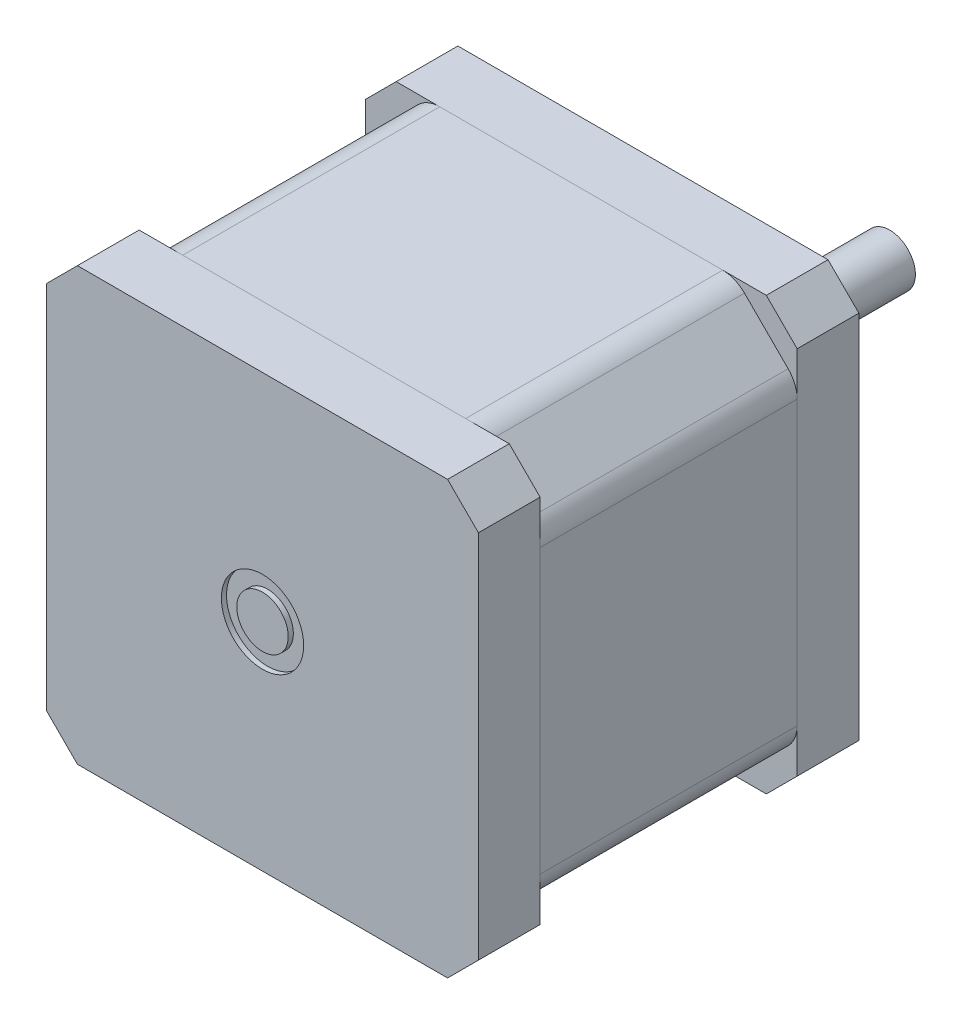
ISO-10303-21;
HEADER;
FILE_DESCRIPTION(('STEP AP214'),'2;1');
FILE_NAME('part.step','',(''),(''),'','','');
FILE_SCHEMA(('AUTOMOTIVE_DESIGN { 1 0 10303 214 1 1 1 1 }'));
ENDSEC;
DATA;
#1=APPLICATION_CONTEXT('core data for automotive mechanical design processes');
#2=APPLICATION_PROTOCOL_DEFINITION('international standard','automotive_design',2000,#1);
#3=PRODUCT_CONTEXT('',#1,'mechanical');
#4=PRODUCT('Part','Part','',(#3));
#5=PRODUCT_RELATED_PRODUCT_CATEGORY('part','',(#4));
#6=PRODUCT_DEFINITION_FORMATION('','',#4);
#7=PRODUCT_DEFINITION_CONTEXT('part definition',#1,'design');
#8=PRODUCT_DEFINITION('design','',#6,#7);
#9=PRODUCT_DEFINITION_SHAPE('','',#8);
#10=(LENGTH_UNIT() NAMED_UNIT(*) SI_UNIT(.MILLI.,.METRE.));
#11=(NAMED_UNIT(*) PLANE_ANGLE_UNIT() SI_UNIT($,.RADIAN.));
#12=(NAMED_UNIT(*) SI_UNIT($,.STERADIAN.) SOLID_ANGLE_UNIT());
#13=UNCERTAINTY_MEASURE_WITH_UNIT(LENGTH_MEASURE(1.E-05),#10,'distance_accuracy_value','');
#14=(GEOMETRIC_REPRESENTATION_CONTEXT(3) GLOBAL_UNCERTAINTY_ASSIGNED_CONTEXT((#13)) GLOBAL_UNIT_ASSIGNED_CONTEXT((#10,
#11,#12)) REPRESENTATION_CONTEXT('',''));
#15=CARTESIAN_POINT('',(0.,0.,0.));
#16=DIRECTION('',(0.,0.,1.));
#17=DIRECTION('',(1.,0.,0.));
#18=AXIS2_PLACEMENT_3D('',#15,#16,#17);
#19=CARTESIAN_POINT('',(-2.,-1.51,-33.26));
#20=DIRECTION('',(-1.,0.,0.));
#21=DIRECTION('',(0.,0.,1.));
#22=AXIS2_PLACEMENT_3D('',#19,#20,#21);
#23=PLANE('',#22);
#24=DIRECTION('',(0.,0.,1.));
#25=VECTOR('',#24,1.);
#26=CARTESIAN_POINT('',(-2.,1.5,-20.375));
#27=LINE('',#26,#25);
#28=CARTESIAN_POINT('',(-2.,1.5,-30.));
#29=VERTEX_POINT('',#28);
#30=CARTESIAN_POINT('',(-2.,1.5,-16.5));
#31=VERTEX_POINT('',#30);
#32=EDGE_CURVE('E317',#29,#31,#27,.T.);
#33=ORIENTED_EDGE('',*,*,#32,.F.);
#34=DIRECTION('',(0.,-1.,0.));
#35=VECTOR('',#34,1.);
#36=CARTESIAN_POINT('',(-2.,-1.51,-30.));
#37=LINE('',#36,#35);
#38=CARTESIAN_POINT('',(-2.,-1.5,-30.));
#39=VERTEX_POINT('',#38);
#40=EDGE_CURVE('E61',#29,#39,#37,.T.);
#41=ORIENTED_EDGE('',*,*,#40,.T.);
#42=DIRECTION('',(0.,0.,-1.));
#43=VECTOR('',#42,1.);
#44=CARTESIAN_POINT('',(-2.,-1.5,-20.375));
#45=LINE('',#44,#43);
#46=CARTESIAN_POINT('',(-2.,-1.5,-16.5));
#47=VERTEX_POINT('',#46);
#48=EDGE_CURVE('E316',#47,#39,#45,.T.);
#49=ORIENTED_EDGE('',*,*,#48,.F.);
#50=DIRECTION('',(0.,1.,0.));
#51=VECTOR('',#50,1.);
#52=CARTESIAN_POINT('',(-2.,0.,-16.5));
#53=LINE('',#52,#51);
#54=EDGE_CURVE('E327',#47,#31,#53,.T.);
#55=ORIENTED_EDGE('',*,*,#54,.T.);
#56=EDGE_LOOP('',(#33,#41,#49,#55));
#57=FACE_BOUND('',#56,.T.);
#58=ADVANCED_FACE('F42',(#57),#23,.T.);
#59=CARTESIAN_POINT('',(0.,0.,-7.5));
#60=DIRECTION('',(0.,0.,-1.));
#61=DIRECTION('',(-1.,0.,0.));
#62=AXIS2_PLACEMENT_3D('',#59,#60,#61);
#63=CYLINDRICAL_SURFACE('',#62,2.5);
#64=CARTESIAN_POINT('',(-2.5,0.,-7.5));
#65=CARTESIAN_POINT('',(-2.50000318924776,-0.0412369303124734,-7.5));
#66=CARTESIAN_POINT('',(-2.49901754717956,-0.0824759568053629,-7.5));
#67=CARTESIAN_POINT('',(-2.4950496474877,-0.16456461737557,-7.5));
#68=CARTESIAN_POINT('',(-2.49208158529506,-0.205414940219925,-7.5));
#69=CARTESIAN_POINT('',(-2.48414960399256,-0.28672671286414,-7.5));
#70=CARTESIAN_POINT('',(-2.47919520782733,-0.327189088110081,-7.5));
#71=CARTESIAN_POINT('',(-2.46729638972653,-0.407724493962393,-7.5));
#72=CARTESIAN_POINT('',(-2.46035660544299,-0.447798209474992,-7.5));
#73=CARTESIAN_POINT('',(-2.44449167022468,-0.52755669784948,-7.5));
#74=CARTESIAN_POINT('',(-2.43556623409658,-0.567241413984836,-7.5));
#75=CARTESIAN_POINT('',(-2.41573514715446,-0.646222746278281,-7.5));
#76=CARTESIAN_POINT('',(-2.40482439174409,-0.685518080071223,-7.5));
#77=CARTESIAN_POINT('',(-2.38102696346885,-0.763721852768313,-7.5));
#78=CARTESIAN_POINT('',(-2.36813060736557,-0.80262734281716,-7.5));
#79=CARTESIAN_POINT('',(-2.34036829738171,-0.880053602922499,-7.5));
#80=CARTESIAN_POINT('',(-2.32548846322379,-0.918569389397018,-7.5));
#81=CARTESIAN_POINT('',(-2.29393205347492,-0.994792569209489,-7.5));
#82=CARTESIAN_POINT('',(-2.27725810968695,-1.03250105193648,-7.5));
#83=CARTESIAN_POINT('',(-2.2422060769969,-1.10679782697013,-7.5));
#84=CARTESIAN_POINT('',(-2.22384065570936,-1.14339208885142,-7.5));
#85=CARTESIAN_POINT('',(-2.18541191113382,-1.21546205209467,-7.5));
#86=CARTESIAN_POINT('',(-2.16535679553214,-1.25094212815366,-7.5));
#87=CARTESIAN_POINT('',(-2.12355272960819,-1.32078531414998,-7.5));
#88=CARTESIAN_POINT('',(-2.10180756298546,-1.35515068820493,-7.5));
#89=CARTESIAN_POINT('',(-2.05662794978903,-1.42276669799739,-7.5));
#90=CARTESIAN_POINT('',(-2.03319301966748,-1.45601701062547,-7.5));
#91=CARTESIAN_POINT('',(-1.98463822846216,-1.52140566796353,-7.5));
#92=CARTESIAN_POINT('',(-1.95951390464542,-1.55354069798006,-7.5));
#93=CARTESIAN_POINT('',(-1.90758378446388,-1.61670149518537,-7.5));
#94=CARTESIAN_POINT('',(-1.88076994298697,-1.64772064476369,-7.5));
#95=CARTESIAN_POINT('',(-1.82546604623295,-1.70865438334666,-7.5));
#96=CARTESIAN_POINT('',(-1.79696486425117,-1.73855886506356,-7.5));
#97=CARTESIAN_POINT('',(-1.73862600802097,-1.79691805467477,-7.5));
#98=CARTESIAN_POINT('',(-1.70879104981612,-1.82537547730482,-7.5));
#99=CARTESIAN_POINT('',(-1.64797517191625,-1.88060303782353,-7.5));
#100=CARTESIAN_POINT('',(-1.61700367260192,-1.90738354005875,-7.5));
#101=CARTESIAN_POINT('',(-1.55392012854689,-1.95926142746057,-7.5));
#102=CARTESIAN_POINT('',(-1.52181399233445,-1.98436599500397,-7.5));
#103=CARTESIAN_POINT('',(-1.45646424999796,-2.03289497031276,-7.5));
#104=CARTESIAN_POINT('',(-1.42322327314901,-2.05632291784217,-7.5));
#105=CARTESIAN_POINT('',(-1.35560722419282,-2.10150247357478,-7.5));
#106=CARTESIAN_POINT('',(-1.32123182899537,-2.1232535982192,-7.5));
#107=CARTESIAN_POINT('',(-1.25134989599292,-2.1650837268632,-7.5));
#108=CARTESIAN_POINT('',(-1.21584050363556,-2.18515796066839,-7.5));
#109=CARTESIAN_POINT('',(-1.14369273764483,-2.22363813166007,-7.5));
#110=CARTESIAN_POINT('',(-1.10704946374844,-2.2420348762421,-7.5));
#111=CARTESIAN_POINT('',(-1.03263699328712,-2.27716642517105,-7.5));
#112=CARTESIAN_POINT('',(-0.994861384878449,-2.29388763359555,-7.5));
#113=CARTESIAN_POINT('',(-0.91863021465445,-2.32547918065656,-7.5));
#114=CARTESIAN_POINT('',(-0.880176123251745,-2.34035306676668,-7.5));
#115=CARTESIAN_POINT('',(-0.802854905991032,-2.36810345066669,-7.5));
#116=CARTESIAN_POINT('',(-0.763992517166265,-2.38099312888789,-7.5));
#117=CARTESIAN_POINT('',(-0.685858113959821,-2.40478102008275,-7.5));
#118=CARTESIAN_POINT('',(-0.646588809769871,-2.41568812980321,-7.5));
#119=CARTESIAN_POINT('',(-0.56764228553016,-2.43551479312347,-7.5));
#120=CARTESIAN_POINT('',(-0.527966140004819,-2.44443862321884,-7.5));
#121=CARTESIAN_POINT('',(-0.448207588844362,-2.46030354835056,-7.5));
#122=CARTESIAN_POINT('',(-0.408125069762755,-2.4672440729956,-7.5));
#123=CARTESIAN_POINT('',(-0.327554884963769,-2.47914741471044,-7.5));
#124=CARTESIAN_POINT('',(-0.287066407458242,-2.48410473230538,-7.5));
#125=CARTESIAN_POINT('',(-0.20568483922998,-2.49204601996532,-7.5));
#126=CARTESIAN_POINT('',(-0.164790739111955,-2.49501962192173,-7.5));
#127=CARTESIAN_POINT('',(-0.0825983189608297,-2.49900052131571,-7.5));
#128=CARTESIAN_POINT('',(-0.0412992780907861,-2.49999280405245,-7.5));
#129=CARTESIAN_POINT('',(0.0412187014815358,-2.50000718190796,-7.5));
#130=CARTESIAN_POINT('',(0.082437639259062,-2.49903311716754,-7.5));
#131=CARTESIAN_POINT('',(0.164492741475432,-2.49508158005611,-7.5));
#132=CARTESIAN_POINT('',(0.205329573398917,-2.49211809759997,-7.5));
#133=CARTESIAN_POINT('',(0.286619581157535,-2.48419450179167,-7.5));
#134=CARTESIAN_POINT('',(0.327073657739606,-2.47924364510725,-7.5));
#135=CARTESIAN_POINT('',(0.407598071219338,-2.46734956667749,-7.5));
#136=CARTESIAN_POINT('',(0.447669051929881,-2.46041070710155,-7.5));
#137=CARTESIAN_POINT('',(0.527427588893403,-2.44454571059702,-7.5));
#138=CARTESIAN_POINT('',(0.56711503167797,-2.43561900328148,-7.5));
#139=CARTESIAN_POINT('',(0.646107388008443,-2.41578338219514,-7.5));
#140=CARTESIAN_POINT('',(0.68541094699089,-2.40486907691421,-7.5));
#141=CARTESIAN_POINT('',(0.763636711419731,-2.38106249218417,-7.5));
#142=CARTESIAN_POINT('',(0.802555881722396,-2.36816024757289,-7.5));
#143=CARTESIAN_POINT('',(0.880015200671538,-2.34038444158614,-7.5));
#144=CARTESIAN_POINT('',(0.918550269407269,-2.32549673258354,-7.5));
#145=CARTESIAN_POINT('',(0.99479244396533,-2.29393175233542,-7.5));
#146=CARTESIAN_POINT('',(1.03250101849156,-2.27725802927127,-7.5));
#147=CARTESIAN_POINT('',(1.10679786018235,-2.24220615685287,-7.5));
#148=CARTESIAN_POINT('',(1.14339209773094,-2.2238406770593,-7.5));
#149=CARTESIAN_POINT('',(1.21546204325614,-2.18541188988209,-7.5));
#150=CARTESIAN_POINT('',(1.25094212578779,-2.16535678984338,-7.5));
#151=CARTESIAN_POINT('',(1.32078531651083,-2.12355273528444,-7.5));
#152=CARTESIAN_POINT('',(1.35515068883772,-2.10180756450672,-7.5));
#153=CARTESIAN_POINT('',(1.42276669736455,-2.0566279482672,-7.5));
#154=CARTESIAN_POINT('',(1.45601701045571,-2.03319301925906,-7.5));
#155=CARTESIAN_POINT('',(1.52140566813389,-1.98463822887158,-7.5));
#156=CARTESIAN_POINT('',(1.55354069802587,-1.95951390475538,-7.5));
#157=CARTESIAN_POINT('',(1.61670149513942,-1.90758378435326,-7.5));
#158=CARTESIAN_POINT('',(1.64772064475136,-1.8807699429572,-7.5));
#159=CARTESIAN_POINT('',(1.70865438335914,-1.82546604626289,-7.5));
#160=CARTESIAN_POINT('',(1.7385588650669,-1.79696486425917,-7.5));
#161=CARTESIAN_POINT('',(1.79691805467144,-1.73862600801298,-7.5));
#162=CARTESIAN_POINT('',(1.82537547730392,-1.708791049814,-7.5));
#163=CARTESIAN_POINT('',(1.88060303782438,-1.6479751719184,-7.5));
#164=CARTESIAN_POINT('',(1.90738354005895,-1.61700367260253,-7.5));
#165=CARTESIAN_POINT('',(1.95926142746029,-1.55392012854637,-7.5));
#166=CARTESIAN_POINT('',(1.98436599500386,-1.52181399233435,-7.5));
#167=CARTESIAN_POINT('',(2.03289497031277,-1.45646424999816,-7.5));
#168=CARTESIAN_POINT('',(2.05632291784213,-1.42322327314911,-7.5));
#169=CARTESIAN_POINT('',(2.10150247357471,-1.35560722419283,-7.5));
#170=CARTESIAN_POINT('',(2.12325359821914,-1.32123182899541,-7.5));
#171=CARTESIAN_POINT('',(2.16508372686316,-1.25134989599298,-7.5));
#172=CARTESIAN_POINT('',(2.18515796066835,-1.21584050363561,-7.5));
#173=CARTESIAN_POINT('',(2.22363813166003,-1.14369273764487,-7.5));
#174=CARTESIAN_POINT('',(2.24203487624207,-1.10704946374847,-7.5));
#175=CARTESIAN_POINT('',(2.27716642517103,-1.03263699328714,-7.5));
#176=CARTESIAN_POINT('',(2.29388763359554,-0.994861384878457,-7.5));
#177=CARTESIAN_POINT('',(2.32547918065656,-0.91863021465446,-7.5));
#178=CARTESIAN_POINT('',(2.34035306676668,-0.880176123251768,-7.5));
#179=CARTESIAN_POINT('',(2.36810345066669,-0.802854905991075,-7.5));
#180=CARTESIAN_POINT('',(2.38099312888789,-0.763992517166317,-7.5));
#181=CARTESIAN_POINT('',(2.40478102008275,-0.685858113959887,-7.5));
#182=CARTESIAN_POINT('',(2.41568812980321,-0.646588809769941,-7.5));
#183=CARTESIAN_POINT('',(2.43551479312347,-0.567642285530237,-7.5));
#184=CARTESIAN_POINT('',(2.44443862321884,-0.527966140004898,-7.5));
#185=CARTESIAN_POINT('',(2.46030354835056,-0.448207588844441,-7.5));
#186=CARTESIAN_POINT('',(2.4672440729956,-0.408125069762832,-7.5));
#187=CARTESIAN_POINT('',(2.47914741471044,-0.32755488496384,-7.5));
#188=CARTESIAN_POINT('',(2.48410473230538,-0.287066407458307,-7.5));
#189=CARTESIAN_POINT('',(2.49204601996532,-0.205684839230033,-7.5));
#190=CARTESIAN_POINT('',(2.49501962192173,-0.164790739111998,-7.5));
#191=CARTESIAN_POINT('',(2.49900052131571,-0.0825983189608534,-7.5));
#192=CARTESIAN_POINT('',(2.49999280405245,-0.0412992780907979,-7.5));
#193=CARTESIAN_POINT('',(2.50000718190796,0.0412187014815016,-7.5));
#194=CARTESIAN_POINT('',(2.49903311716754,0.0824376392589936,-7.5));
#195=CARTESIAN_POINT('',(2.49508158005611,0.164492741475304,-7.5));
#196=CARTESIAN_POINT('',(2.49211809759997,0.205329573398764,-7.5));
#197=CARTESIAN_POINT('',(2.48419450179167,0.286619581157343,-7.5));
#198=CARTESIAN_POINT('',(2.47924364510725,0.327073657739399,-7.5));
#199=CARTESIAN_POINT('',(2.46734956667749,0.407598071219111,-7.5));
#200=CARTESIAN_POINT('',(2.46041070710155,0.44766905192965,-7.5));
#201=CARTESIAN_POINT('',(2.44454571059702,0.527427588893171,-7.5));
#202=CARTESIAN_POINT('',(2.43561900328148,0.567115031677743,-7.5));
#203=CARTESIAN_POINT('',(2.41578338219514,0.646107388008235,-7.5));
#204=CARTESIAN_POINT('',(2.40486907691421,0.685410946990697,-7.5));
#205=CARTESIAN_POINT('',(2.38106249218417,0.763636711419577,-7.5));
#206=CARTESIAN_POINT('',(2.36816024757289,0.802555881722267,-7.5));
#207=CARTESIAN_POINT('',(2.34038444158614,0.880015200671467,-7.5));
#208=CARTESIAN_POINT('',(2.32549673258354,0.918550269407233,-7.5));
#209=CARTESIAN_POINT('',(2.29393175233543,0.994792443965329,-7.5));
#210=CARTESIAN_POINT('',(2.2772580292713,1.03250101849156,-7.5));
#211=CARTESIAN_POINT('',(2.24220615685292,1.10679786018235,-7.5));
#212=CARTESIAN_POINT('',(2.22384067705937,1.14339209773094,-7.5));
#213=CARTESIAN_POINT('',(2.18541188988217,1.21546204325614,-7.5));
#214=CARTESIAN_POINT('',(2.16535678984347,1.25094212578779,-7.5));
#215=CARTESIAN_POINT('',(2.12355273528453,1.32078531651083,-7.5));
#216=CARTESIAN_POINT('',(2.10180756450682,1.35515068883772,-7.5));
#217=CARTESIAN_POINT('',(2.0566279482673,1.42276669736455,-7.5));
#218=CARTESIAN_POINT('',(2.03319301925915,1.45601701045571,-7.5));
#219=CARTESIAN_POINT('',(1.98463822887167,1.5214056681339,-7.5));
#220=CARTESIAN_POINT('',(1.95951390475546,1.55354069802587,-7.5));
#221=CARTESIAN_POINT('',(1.90758378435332,1.61670149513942,-7.5));
#222=CARTESIAN_POINT('',(1.88076994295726,1.64772064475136,-7.5));
#223=CARTESIAN_POINT('',(1.82546604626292,1.70865438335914,-7.5));
#224=CARTESIAN_POINT('',(1.79696486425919,1.7385588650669,-7.5));
#225=CARTESIAN_POINT('',(1.73862600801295,1.79691805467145,-7.5));
#226=CARTESIAN_POINT('',(1.70879104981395,1.82537547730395,-7.5));
#227=CARTESIAN_POINT('',(1.6479751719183,1.88060303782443,-7.5));
#228=CARTESIAN_POINT('',(1.6170036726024,1.90738354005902,-7.5));
#229=CARTESIAN_POINT('',(1.55392012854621,1.95926142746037,-7.5));
#230=CARTESIAN_POINT('',(1.52181399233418,1.98436599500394,-7.5));
#231=CARTESIAN_POINT('',(1.45646424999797,2.03289497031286,-7.5));
#232=CARTESIAN_POINT('',(1.42322327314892,2.05632291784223,-7.5));
#233=CARTESIAN_POINT('',(1.35560722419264,2.1015024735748,-7.5));
#234=CARTESIAN_POINT('',(1.32123182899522,2.12325359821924,-7.5));
#235=CARTESIAN_POINT('',(1.25134989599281,2.16508372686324,-7.5));
#236=CARTESIAN_POINT('',(1.21584050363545,2.18515796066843,-7.5));
#237=CARTESIAN_POINT('',(1.14369273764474,2.2236381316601,-7.5));
#238=CARTESIAN_POINT('',(1.10704946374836,2.24203487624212,-7.5));
#239=CARTESIAN_POINT('',(1.03263699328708,2.27716642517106,-7.5));
#240=CARTESIAN_POINT('',(0.994861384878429,2.29388763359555,-7.5));
#241=CARTESIAN_POINT('',(0.918630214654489,2.32547918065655,-7.5));
#242=CARTESIAN_POINT('',(0.880176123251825,2.34035306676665,-7.5));
#243=CARTESIAN_POINT('',(0.802854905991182,2.36810345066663,-7.5));
#244=CARTESIAN_POINT('',(0.763992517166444,2.38099312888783,-7.5));
#245=CARTESIAN_POINT('',(0.685858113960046,2.40478102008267,-7.5));
#246=CARTESIAN_POINT('',(0.646588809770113,2.41568812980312,-7.5));
#247=CARTESIAN_POINT('',(0.567642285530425,2.43551479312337,-7.5));
#248=CARTESIAN_POINT('',(0.52796614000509,2.44443862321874,-7.5));
#249=CARTESIAN_POINT('',(0.448207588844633,2.46030354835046,-7.5));
#250=CARTESIAN_POINT('',(0.40812506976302,2.46724407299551,-7.5));
#251=CARTESIAN_POINT('',(0.327554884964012,2.47914741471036,-7.5));
#252=CARTESIAN_POINT('',(0.287066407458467,2.4841047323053,-7.5));
#253=CARTESIAN_POINT('',(0.20568483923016,2.49204601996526,-7.5));
#254=CARTESIAN_POINT('',(0.164790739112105,2.49501962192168,-7.5));
#255=CARTESIAN_POINT('',(0.0825983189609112,2.49900052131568,-7.5));
#256=CARTESIAN_POINT('',(0.041299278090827,2.49999280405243,-7.5));
#257=CARTESIAN_POINT('',(-0.0412187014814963,2.50000718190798,-7.5));
#258=CARTESIAN_POINT('',(-0.0824376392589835,2.49903311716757,-7.5));
#259=CARTESIAN_POINT('',(-0.164492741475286,2.49508158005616,-7.5));
#260=CARTESIAN_POINT('',(-0.205329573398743,2.49211809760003,-7.5));
#261=CARTESIAN_POINT('',(-0.286619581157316,2.48419450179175,-7.5));
#262=CARTESIAN_POINT('',(-0.32707365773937,2.47924364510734,-7.5));
#263=CARTESIAN_POINT('',(-0.407598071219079,2.46734956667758,-7.5));
#264=CARTESIAN_POINT('',(-0.447669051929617,2.46041070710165,-7.5));
#265=CARTESIAN_POINT('',(-0.527427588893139,2.44454571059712,-7.5));
#266=CARTESIAN_POINT('',(-0.567115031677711,2.43561900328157,-7.5));
#267=CARTESIAN_POINT('',(-0.646107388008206,2.41578338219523,-7.5));
#268=CARTESIAN_POINT('',(-0.685410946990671,2.40486907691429,-7.5));
#269=CARTESIAN_POINT('',(-0.763636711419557,2.38106249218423,-7.5));
#270=CARTESIAN_POINT('',(-0.80255588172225,2.36816024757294,-7.5));
#271=CARTESIAN_POINT('',(-0.880015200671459,2.34038444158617,-7.5));
#272=CARTESIAN_POINT('',(-0.918550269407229,2.32549673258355,-7.5));
#273=CARTESIAN_POINT('',(-0.994792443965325,2.29393175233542,-7.5));
#274=CARTESIAN_POINT('',(-1.03250101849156,2.27725802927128,-7.5));
#275=CARTESIAN_POINT('',(-1.10679786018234,2.24220615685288,-7.5));
#276=CARTESIAN_POINT('',(-1.14339209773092,2.22384067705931,-7.5));
#277=CARTESIAN_POINT('',(-1.21546204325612,2.18541188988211,-7.5));
#278=CARTESIAN_POINT('',(-1.25094212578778,2.1653567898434,-7.5));
#279=CARTESIAN_POINT('',(-1.32078531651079,2.12355273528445,-7.5));
#280=CARTESIAN_POINT('',(-1.35515068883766,2.10180756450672,-7.5));
#281=CARTESIAN_POINT('',(-1.42276669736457,2.05662794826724,-7.5));
#282=CARTESIAN_POINT('',(-1.45601701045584,2.03319301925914,-7.5));
#283=CARTESIAN_POINT('',(-1.52140566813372,1.98463822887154,-7.5));
#284=CARTESIAN_POINT('',(-1.55354069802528,1.95951390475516,-7.5));
#285=CARTESIAN_POINT('',(-1.61670149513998,1.90758378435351,-7.5));
#286=CARTESIAN_POINT('',(-1.64772064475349,1.8807699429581,-7.5));
#287=CARTESIAN_POINT('',(-1.70865438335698,1.825466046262,-7.5));
#288=CARTESIAN_POINT('',(-1.73855886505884,1.79696486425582,-7.5));
#289=CARTESIAN_POINT('',(-1.79691805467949,1.73862600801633,-7.5));
#290=CARTESIAN_POINT('',(-1.82537547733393,1.70879104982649,-7.5));
#291=CARTESIAN_POINT('',(-1.88060303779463,1.64797517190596,-7.5));
#292=CARTESIAN_POINT('',(-1.90738353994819,1.61700367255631,-7.5));
#293=CARTESIAN_POINT('',(-1.95926142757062,1.5539201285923,-7.5));
#294=CARTESIAN_POINT('',(-1.98436599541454,1.52181399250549,-7.5));
#295=CARTESIAN_POINT('',(-2.03289496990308,1.4564642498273,-7.5));
#296=CARTESIAN_POINT('',(-2.05632291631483,1.42322327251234,-7.5));
#297=CARTESIAN_POINT('',(-2.10150247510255,1.35560722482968,-7.5));
#298=CARTESIAN_POINT('',(-2.12325360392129,1.32123183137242,-7.5));
#299=CARTESIAN_POINT('',(-2.16508372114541,1.25134989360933,-7.5));
#300=CARTESIAN_POINT('',(-2.18515793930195,1.21584049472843,-7.5));
#301=CARTESIAN_POINT('',(-2.22363815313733,1.14369274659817,-7.5));
#302=CARTESIAN_POINT('',(-2.24203495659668,1.10704949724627,-7.5));
#303=CARTESIAN_POINT('',(-2.27716634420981,1.0326369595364,-7.5));
#304=CARTESIAN_POINT('',(-2.2938873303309,0.994861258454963,-7.5));
#305=CARTESIAN_POINT('',(-2.32548746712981,0.918611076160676,-7.5));
#306=CARTESIAN_POINT('',(-2.3403692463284,0.880137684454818,-7.5));
#307=CARTESIAN_POINT('',(-2.36813315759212,0.802783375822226,-7.5));
#308=CARTESIAN_POINT('',(-2.38102873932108,0.763907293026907,-7.5));
#309=CARTESIAN_POINT('',(-2.404825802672,0.685750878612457,-7.5));
#310=CARTESIAN_POINT('',(-2.41573646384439,0.646473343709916,-7.5));
#311=CARTESIAN_POINT('',(-2.43556768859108,0.567515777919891,-7.5));
#312=CARTESIAN_POINT('',(-2.44449281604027,0.52783689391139,-7.5));
#313=CARTESIAN_POINT('',(-2.46035773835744,0.448078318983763,-7.5));
#314=CARTESIAN_POINT('',(-2.46729724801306,0.407998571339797,-7.5));
#315=CARTESIAN_POINT('',(-2.47919607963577,0.327439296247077,-7.5));
#316=CARTESIAN_POINT('',(-2.48415017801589,0.286958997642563,-7.5));
#317=CARTESIAN_POINT('',(-2.49208216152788,0.205599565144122,-7.5));
#318=CARTESIAN_POINT('',(-2.49504993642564,0.164719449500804,-7.5));
#319=CARTESIAN_POINT('',(-2.4990178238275,0.0825593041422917,-7.5));
#320=CARTESIAN_POINT('',(-2.50000316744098,0.0412785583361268,-7.5));
#321=CARTESIAN_POINT('',(-2.5,0.,-7.5));
#322=B_SPLINE_CURVE_WITH_KNOTS('',3,(#64,#65,#66,#67,#68,#69,#70,#71,#72,#73,#74,#75,#76,#77,
#78,#79,#80,#81,#82,#83,#84,#85,#86,#87,#88,#89,#90,#91,#92,#93,#94,#95,#96,#97,#98,#99,#100,
#101,#102,#103,#104,#105,#106,#107,#108,#109,#110,#111,#112,#113,#114,#115,#116,#117,#118,#119,
#120,#121,#122,#123,#124,#125,#126,#127,#128,#129,#130,#131,#132,#133,#134,#135,#136,#137,#138,
#139,#140,#141,#142,#143,#144,#145,#146,#147,#148,#149,#150,#151,#152,#153,#154,#155,#156,#157,
#158,#159,#160,#161,#162,#163,#164,#165,#166,#167,#168,#169,#170,#171,#172,#173,#174,#175,#176,
#177,#178,#179,#180,#181,#182,#183,#184,#185,#186,#187,#188,#189,#190,#191,#192,#193,#194,#195,
#196,#197,#198,#199,#200,#201,#202,#203,#204,#205,#206,#207,#208,#209,#210,#211,#212,#213,#214,
#215,#216,#217,#218,#219,#220,#221,#222,#223,#224,#225,#226,#227,#228,#229,#230,#231,#232,#233,
#234,#235,#236,#237,#238,#239,#240,#241,#242,#243,#244,#245,#246,#247,#248,#249,#250,#251,#252,
#253,#254,#255,#256,#257,#258,#259,#260,#261,#262,#263,#264,#265,#266,#267,#268,#269,#270,#271,
#272,#273,#274,#275,#276,#277,#278,#279,#280,#281,#282,#283,#284,#285,#286,#287,#288,#289,#290,
#291,#292,#293,#294,#295,#296,#297,#298,#299,#300,#301,#302,#303,#304,#305,#306,#307,#308,#309,
#310,#311,#312,#313,#314,#315,#316,#317,#318,#319,#320,#321),.UNSPECIFIED.,.F.,.F.,(4,2,2,2,2,2,
2,2,2,2,2,2,2,2,2,2,2,2,2,2,2,2,2,2,2,2,2,2,2,2,2,2,2,2,2,2,2,2,2,2,2,2,2,2,2,2,2,2,2,2,2,2,2,2,
2,2,2,2,2,2,2,2,2,2,2,2,2,2,2,2,2,2,2,2,2,2,2,2,2,2,2,2,2,2,2,2,2,2,2,2,2,2,2,2,2,2,2,2,2,2,2,2,
2,2,2,2,2,2,2,2,2,2,2,2,2,2,2,2,2,2,2,2,2,2,2,2,2,2,4),(0.,0.123701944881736,0.246527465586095,
0.368771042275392,0.490731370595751,0.612709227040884,0.735005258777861,0.857917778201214,
0.98174064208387,1.1053842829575,1.22816742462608,1.35038519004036,1.4723368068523,
1.59432346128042,1.71664608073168,1.83960312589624,1.96348847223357,2.08713211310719,
2.20991525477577,2.33213302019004,2.45408463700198,2.57607129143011,2.69839391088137,
2.82135095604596,2.94523630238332,3.06887994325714,3.19166308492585,3.31388085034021,
3.43583246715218,3.55781912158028,3.68014174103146,3.8030987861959,3.92698413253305,
4.05062777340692,4.17341091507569,4.29562868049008,4.41758029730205,4.53956695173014,
4.66188957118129,4.78484661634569,4.90873196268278,5.03237560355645,5.15515874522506,
5.27737651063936,5.39932812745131,5.52131478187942,5.64363740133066,5.76659444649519,
5.89047979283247,6.01412343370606,6.13690657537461,6.25912434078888,6.38107595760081,
6.50306261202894,6.62538523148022,6.74834227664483,6.87222762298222,6.99587126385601,
7.1186544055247,7.24087217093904,7.36282378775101,7.48481044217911,7.6071330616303,
7.73009010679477,7.85397545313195,7.97761909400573,8.10040223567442,8.22262000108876,
8.34457161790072,8.46655827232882,8.58888089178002,8.71183793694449,8.83572328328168,
8.95936692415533,9.08215006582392,9.20436783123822,9.32631944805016,9.44830610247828,
9.57062872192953,9.69358576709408,9.81747111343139,9.94111475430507,10.0638978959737,
10.186115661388,10.3080672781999,10.4300539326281,10.5523765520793,10.6753335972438,
10.7992189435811,10.9228625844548,11.0456457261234,11.1678634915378,11.2898151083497,
11.4118017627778,11.534124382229,11.6570814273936,11.7809667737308,11.9046104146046,
12.0273935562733,12.1496113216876,12.2715629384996,12.3935495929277,12.5158722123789,
12.6388292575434,12.7627146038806,12.8863582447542,13.0091413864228,13.1313591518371,
13.2533107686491,13.3752974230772,13.4976200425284,13.620577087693,13.7444624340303,
13.8681060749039,13.9908892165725,14.1131069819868,14.2350585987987,14.3570452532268,
14.4793678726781,14.6023249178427,14.72621026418,14.8499164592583,14.972744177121,
15.0949885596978,15.216948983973,15.3389269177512,15.4612236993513,15.5841383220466,
15.7079653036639),.UNSPECIFIED.);
#323=CARTESIAN_POINT('',(-2.5,0.,-7.5));
#324=VERTEX_POINT('',#323);
#325=EDGE_CURVE('E331',#324,#324,#322,.T.);
#326=ORIENTED_EDGE('',*,*,#325,.F.);
#327=EDGE_LOOP('',(#326));
#328=FACE_BOUND('',#327,.T.);
#329=ORIENTED_EDGE('',*,*,#48,.T.);
#330=CARTESIAN_POINT('',(0.,0.,-30.));
#331=DIRECTION('',(0.,0.,-1.));
#332=DIRECTION('',(-1.,0.,0.));
#333=AXIS2_PLACEMENT_3D('',#330,#331,#332);
#334=CIRCLE('',#333,2.5);
#335=EDGE_CURVE('E11',#39,#29,#334,.F.);
#336=ORIENTED_EDGE('',*,*,#335,.T.);
#337=ORIENTED_EDGE('',*,*,#32,.T.);
#338=CARTESIAN_POINT('',(-2.5,0.,-16.5));
#339=CARTESIAN_POINT('',(-2.5,0.389491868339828,-16.5));
#340=CARTESIAN_POINT('',(-2.38135390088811,0.761021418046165,-16.5));
#341=CARTESIAN_POINT('',(-2.25315761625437,1.16245651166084,-16.5));
#342=CARTESIAN_POINT('',(-2.,1.5,-16.5));
#343=B_SPLINE_CURVE_WITH_KNOTS('',2,(#338,#339,#340,#341,#342),.UNSPECIFIED.,.F.,.F.,(3,2,3),
(0.,0.5,1.),.UNSPECIFIED.);
#344=CARTESIAN_POINT('',(-2.5,0.,-16.5));
#345=VERTEX_POINT('',#344);
#346=EDGE_CURVE('E333',#345,#31,#343,.T.);
#347=ORIENTED_EDGE('',*,*,#346,.F.);
#348=CARTESIAN_POINT('',(-2.,-1.5,-16.5));
#349=CARTESIAN_POINT('',(-2.25283547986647,-1.16288602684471,-16.5));
#350=CARTESIAN_POINT('',(-2.38135390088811,-0.761021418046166,-16.5));
#351=CARTESIAN_POINT('',(-2.5,-0.390026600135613,-16.5));
#352=CARTESIAN_POINT('',(-2.5,0.,-16.5));
#353=B_SPLINE_CURVE_WITH_KNOTS('',2,(#348,#349,#350,#351,#352),.UNSPECIFIED.,.F.,.F.,(3,2,3),
(0.,0.5,1.),.UNSPECIFIED.);
#354=EDGE_CURVE('E323',#47,#345,#353,.T.);
#355=ORIENTED_EDGE('',*,*,#354,.F.);
#356=EDGE_LOOP('',(#329,#336,#337,#347,#355));
#357=FACE_BOUND('',#356,.T.);
#358=ADVANCED_FACE('F321',(#328,#357),#63,.T.);
#359=CARTESIAN_POINT('',(0.,0.,-8.5));
#360=DIRECTION('',(0.,0.,-1.));
#361=DIRECTION('',(-1.,0.,0.));
#362=AXIS2_PLACEMENT_3D('',#359,#360,#361);
#363=CYLINDRICAL_SURFACE('',#362,11.);
#364=CARTESIAN_POINT('',(0.,0.,-6.));
#365=DIRECTION('',(0.,0.,-1.));
#366=DIRECTION('',(-1.,0.,0.));
#367=AXIS2_PLACEMENT_3D('',#364,#365,#366);
#368=CIRCLE('',#367,11.);
#369=CARTESIAN_POINT('',(-11.,0.,-6.));
#370=VERTEX_POINT('',#369);
#371=EDGE_CURVE('E569',#370,#370,#368,.T.);
#372=ORIENTED_EDGE('',*,*,#371,.T.);
#373=EDGE_LOOP('',(#372));
#374=FACE_BOUND('',#373,.T.);
#375=CARTESIAN_POINT('',(0.,0.,-8.));
#376=DIRECTION('',(0.,0.,-1.));
#377=DIRECTION('',(-1.,0.,0.));
#378=AXIS2_PLACEMENT_3D('',#375,#376,#377);
#379=CIRCLE('',#378,11.);
#380=CARTESIAN_POINT('',(-11.,0.,-8.));
#381=VERTEX_POINT('',#380);
#382=EDGE_CURVE('E1768',#381,#381,#379,.T.);
#383=ORIENTED_EDGE('',*,*,#382,.F.);
#384=EDGE_LOOP('',(#383));
#385=FACE_BOUND('',#384,.T.);
#386=ADVANCED_FACE('F1279',(#374,#385),#363,.T.);
#387=CARTESIAN_POINT('',(17.9929289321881,-21.0070710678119,32.51));
#388=DIRECTION('',(0.707106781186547,-0.707106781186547,0.));
#389=DIRECTION('',(0.,0.,-1.));
#390=AXIS2_PLACEMENT_3D('',#387,#388,#389);
#391=PLANE('',#390);
#392=DIRECTION('',(0.,0.,-1.));
#393=VECTOR('',#392,1.);
#394=CARTESIAN_POINT('',(21.,-18.,28.75));
#395=LINE('',#394,#393);
#396=CARTESIAN_POINT('',(21.,-18.,31.));
#397=VERTEX_POINT('',#396);
#398=CARTESIAN_POINT('',(21.,-18.,25.));
#399=VERTEX_POINT('',#398);
#400=EDGE_CURVE('E349',#397,#399,#395,.T.);
#401=ORIENTED_EDGE('',*,*,#400,.F.);
#402=DIRECTION('',(0.707106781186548,0.707106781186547,0.));
#403=VECTOR('',#402,1.);
#404=CARTESIAN_POINT('',(18.,-21.,31.));
#405=LINE('',#404,#403);
#406=CARTESIAN_POINT('',(18.,-21.,31.));
#407=VERTEX_POINT('',#406);
#408=EDGE_CURVE('E551',#407,#397,#405,.T.);
#409=ORIENTED_EDGE('',*,*,#408,.F.);
#410=DIRECTION('',(0.,0.,-1.));
#411=VECTOR('',#410,1.);
#412=CARTESIAN_POINT('',(18.,-21.,28.75));
#413=LINE('',#412,#411);
#414=CARTESIAN_POINT('',(18.,-21.,25.));
#415=VERTEX_POINT('',#414);
#416=EDGE_CURVE('E362',#407,#415,#413,.T.);
#417=ORIENTED_EDGE('',*,*,#416,.T.);
#418=DIRECTION('',(0.707106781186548,0.707106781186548,0.));
#419=VECTOR('',#418,1.);
#420=CARTESIAN_POINT('',(19.5,-19.5,25.));
#421=LINE('',#420,#419);
#422=EDGE_CURVE('E366',#415,#399,#421,.T.);
#423=ORIENTED_EDGE('',*,*,#422,.T.);
#424=EDGE_LOOP('',(#401,#409,#417,#423));
#425=FACE_BOUND('',#424,.T.);
#426=ADVANCED_FACE('F1690',(#425),#391,.T.);
#427=CARTESIAN_POINT('',(21.0070710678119,17.9929289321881,32.51));
#428=DIRECTION('',(0.707106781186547,0.707106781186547,0.));
#429=DIRECTION('',(0.,0.,-1.));
#430=AXIS2_PLACEMENT_3D('',#427,#428,#429);
#431=PLANE('',#430);
#432=DIRECTION('',(0.,0.,-1.));
#433=VECTOR('',#432,1.);
#434=CARTESIAN_POINT('',(18.,21.,28.75));
#435=LINE('',#434,#433);
#436=CARTESIAN_POINT('',(18.,21.,31.));
#437=VERTEX_POINT('',#436);
#438=CARTESIAN_POINT('',(18.,21.,25.));
#439=VERTEX_POINT('',#438);
#440=EDGE_CURVE('E371',#437,#439,#435,.T.);
#441=ORIENTED_EDGE('',*,*,#440,.F.);
#442=DIRECTION('',(-0.707106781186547,0.707106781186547,0.));
#443=VECTOR('',#442,1.);
#444=CARTESIAN_POINT('',(21.,18.,31.));
#445=LINE('',#444,#443);
#446=CARTESIAN_POINT('',(21.,18.,31.));
#447=VERTEX_POINT('',#446);
#448=EDGE_CURVE('E1776',#447,#437,#445,.T.);
#449=ORIENTED_EDGE('',*,*,#448,.F.);
#450=DIRECTION('',(0.,0.,-1.));
#451=VECTOR('',#450,1.);
#452=CARTESIAN_POINT('',(21.,18.,28.75));
#453=LINE('',#452,#451);
#454=CARTESIAN_POINT('',(21.,18.,25.));
#455=VERTEX_POINT('',#454);
#456=EDGE_CURVE('E344',#447,#455,#453,.T.);
#457=ORIENTED_EDGE('',*,*,#456,.T.);
#458=DIRECTION('',(-0.707106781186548,0.707106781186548,0.));
#459=VECTOR('',#458,1.);
#460=CARTESIAN_POINT('',(19.5,19.5,25.));
#461=LINE('',#460,#459);
#462=EDGE_CURVE('E348',#455,#439,#461,.T.);
#463=ORIENTED_EDGE('',*,*,#462,.T.);
#464=EDGE_LOOP('',(#441,#449,#457,#463));
#465=FACE_BOUND('',#464,.T.);
#466=ADVANCED_FACE('F850',(#465),#431,.T.);
#467=CARTESIAN_POINT('',(-17.9929289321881,-21.0070710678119,24.99));
#468=DIRECTION('',(-0.707106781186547,-0.707106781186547,0.));
#469=DIRECTION('',(0.,0.,1.));
#470=AXIS2_PLACEMENT_3D('',#467,#468,#469);
#471=PLANE('',#470);
#472=DIRECTION('',(0.,0.,1.));
#473=VECTOR('',#472,1.);
#474=CARTESIAN_POINT('',(-18.,-21.,28.75));
#475=LINE('',#474,#473);
#476=CARTESIAN_POINT('',(-18.,-21.,25.));
#477=VERTEX_POINT('',#476);
#478=CARTESIAN_POINT('',(-18.,-21.,31.));
#479=VERTEX_POINT('',#478);
#480=EDGE_CURVE('E360',#477,#479,#475,.T.);
#481=ORIENTED_EDGE('',*,*,#480,.T.);
#482=DIRECTION('',(0.707106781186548,-0.707106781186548,0.));
#483=VECTOR('',#482,1.);
#484=CARTESIAN_POINT('',(-21.,-18.,31.));
#485=LINE('',#484,#483);
#486=CARTESIAN_POINT('',(-21.,-18.,31.));
#487=VERTEX_POINT('',#486);
#488=EDGE_CURVE('E539',#487,#479,#485,.T.);
#489=ORIENTED_EDGE('',*,*,#488,.F.);
#490=DIRECTION('',(0.,0.,1.));
#491=VECTOR('',#490,1.);
#492=CARTESIAN_POINT('',(-21.,-18.,28.75));
#493=LINE('',#492,#491);
#494=CARTESIAN_POINT('',(-21.,-18.,25.));
#495=VERTEX_POINT('',#494);
#496=EDGE_CURVE('E443',#495,#487,#493,.T.);
#497=ORIENTED_EDGE('',*,*,#496,.F.);
#498=DIRECTION('',(0.707106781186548,-0.707106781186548,0.));
#499=VECTOR('',#498,1.);
#500=CARTESIAN_POINT('',(-19.5,-19.5,25.));
#501=LINE('',#500,#499);
#502=EDGE_CURVE('E522',#495,#477,#501,.T.);
#503=ORIENTED_EDGE('',*,*,#502,.T.);
#504=EDGE_LOOP('',(#481,#489,#497,#503));
#505=FACE_BOUND('',#504,.T.);
#506=ADVANCED_FACE('F538',(#505),#471,.T.);
#507=CARTESIAN_POINT('',(-21.0070710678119,17.9929289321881,24.99));
#508=DIRECTION('',(-0.707106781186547,0.707106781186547,0.));
#509=DIRECTION('',(0.,0.,1.));
#510=AXIS2_PLACEMENT_3D('',#507,#508,#509);
#511=PLANE('',#510);
#512=DIRECTION('',(0.,0.,-1.));
#513=VECTOR('',#512,1.);
#514=CARTESIAN_POINT('',(-21.,18.,28.75));
#515=LINE('',#514,#513);
#516=CARTESIAN_POINT('',(-21.,18.,31.));
#517=VERTEX_POINT('',#516);
#518=CARTESIAN_POINT('',(-21.,18.,25.));
#519=VERTEX_POINT('',#518);
#520=EDGE_CURVE('E440',#517,#519,#515,.T.);
#521=ORIENTED_EDGE('',*,*,#520,.F.);
#522=DIRECTION('',(-0.707106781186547,-0.707106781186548,0.));
#523=VECTOR('',#522,1.);
#524=CARTESIAN_POINT('',(-18.,21.,31.));
#525=LINE('',#524,#523);
#526=CARTESIAN_POINT('',(-18.,21.,31.));
#527=VERTEX_POINT('',#526);
#528=EDGE_CURVE('E68',#527,#517,#525,.T.);
#529=ORIENTED_EDGE('',*,*,#528,.F.);
#530=DIRECTION('',(0.,0.,-1.));
#531=VECTOR('',#530,1.);
#532=CARTESIAN_POINT('',(-18.,21.,28.75));
#533=LINE('',#532,#531);
#534=CARTESIAN_POINT('',(-18.,21.,25.));
#535=VERTEX_POINT('',#534);
#536=EDGE_CURVE('E367',#527,#535,#533,.T.);
#537=ORIENTED_EDGE('',*,*,#536,.T.);
#538=CARTESIAN_POINT('',(-21.,18.,25.));
#539=DIRECTION('',(0.707106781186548,0.707106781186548,0.));
#540=VECTOR('',#539,1.);
#541=LINE('',#538,#540);
#542=EDGE_CURVE('E491',#519,#535,#541,.T.);
#543=ORIENTED_EDGE('',*,*,#542,.F.);
#544=EDGE_LOOP('',(#521,#529,#537,#543));
#545=FACE_BOUND('',#544,.T.);
#546=ADVANCED_FACE('F1689',(#545),#511,.T.);
#547=CARTESIAN_POINT('',(21.,-18.01,32.51));
#548=DIRECTION('',(1.,0.,0.));
#549=DIRECTION('',(0.,0.,-1.));
#550=AXIS2_PLACEMENT_3D('',#547,#548,#549);
#551=PLANE('',#550);
#552=ORIENTED_EDGE('',*,*,#456,.F.);
#553=DIRECTION('',(0.,1.,0.));
#554=VECTOR('',#553,1.);
#555=CARTESIAN_POINT('',(21.,-18.,31.));
#556=LINE('',#555,#554);
#557=EDGE_CURVE('E1772',#397,#447,#556,.T.);
#558=ORIENTED_EDGE('',*,*,#557,.F.);
#559=ORIENTED_EDGE('',*,*,#400,.T.);
#560=DIRECTION('',(0.,1.,0.));
#561=VECTOR('',#560,1.);
#562=CARTESIAN_POINT('',(21.,0.,25.));
#563=LINE('',#562,#561);
#564=CARTESIAN_POINT('',(20.9997723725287,-13.7570178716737,25.));
#565=VERTEX_POINT('',#564);
#566=EDGE_CURVE('E365',#399,#565,#563,.T.);
#567=ORIENTED_EDGE('',*,*,#566,.T.);
#568=CARTESIAN_POINT('',(21.,-13.7570178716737,25.));
#569=DIRECTION('',(0.,1.,0.));
#570=VECTOR('',#569,1.);
#571=LINE('',#568,#570);
#572=CARTESIAN_POINT('',(20.9997723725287,13.7570178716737,25.));
#573=VERTEX_POINT('',#572);
#574=EDGE_CURVE('E905',#565,#573,#571,.T.);
#575=ORIENTED_EDGE('',*,*,#574,.T.);
#576=DIRECTION('',(0.,1.,0.));
#577=VECTOR('',#576,1.);
#578=CARTESIAN_POINT('',(21.,0.,25.));
#579=LINE('',#578,#577);
#580=EDGE_CURVE('E902',#573,#455,#579,.T.);
#581=ORIENTED_EDGE('',*,*,#580,.T.);
#582=EDGE_LOOP('',(#552,#558,#559,#567,#575,#581));
#583=FACE_BOUND('',#582,.T.);
#584=ADVANCED_FACE('F1681',(#583),#551,.T.);
#585=CARTESIAN_POINT('',(-18.01,-21.,32.51));
#586=DIRECTION('',(0.,-1.,0.));
#587=DIRECTION('',(0.,0.,-1.));
#588=AXIS2_PLACEMENT_3D('',#585,#586,#587);
#589=PLANE('',#588);
#590=ORIENTED_EDGE('',*,*,#416,.F.);
#591=DIRECTION('',(1.,0.,0.));
#592=VECTOR('',#591,1.);
#593=CARTESIAN_POINT('',(-18.,-21.,31.));
#594=LINE('',#593,#592);
#595=EDGE_CURVE('E547',#479,#407,#594,.T.);
#596=ORIENTED_EDGE('',*,*,#595,.F.);
#597=ORIENTED_EDGE('',*,*,#480,.F.);
#598=DIRECTION('',(-1.,0.,0.));
#599=VECTOR('',#598,1.);
#600=CARTESIAN_POINT('',(-17.3785089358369,-21.,25.));
#601=LINE('',#600,#599);
#602=CARTESIAN_POINT('',(-13.7570178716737,-20.9997723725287,25.));
#603=VERTEX_POINT('',#602);
#604=EDGE_CURVE('E519',#603,#477,#601,.T.);
#605=ORIENTED_EDGE('',*,*,#604,.F.);
#606=CARTESIAN_POINT('',(-13.7570178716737,-21.,25.));
#607=DIRECTION('',(1.,0.,0.));
#608=VECTOR('',#607,1.);
#609=LINE('',#606,#608);
#610=CARTESIAN_POINT('',(13.7570178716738,-20.9997723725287,25.));
#611=VERTEX_POINT('',#610);
#612=EDGE_CURVE('E932',#603,#611,#609,.T.);
#613=ORIENTED_EDGE('',*,*,#612,.T.);
#614=DIRECTION('',(1.,0.,0.));
#615=VECTOR('',#614,1.);
#616=CARTESIAN_POINT('',(0.,-21.,25.));
#617=LINE('',#616,#615);
#618=EDGE_CURVE('E910',#611,#415,#617,.T.);
#619=ORIENTED_EDGE('',*,*,#618,.T.);
#620=EDGE_LOOP('',(#590,#596,#597,#605,#613,#619));
#621=FACE_BOUND('',#620,.T.);
#622=ADVANCED_FACE('F544',(#621),#589,.T.);
#623=CARTESIAN_POINT('',(-18.01,21.,24.99));
#624=DIRECTION('',(0.,1.,0.));
#625=DIRECTION('',(0.,0.,1.));
#626=AXIS2_PLACEMENT_3D('',#623,#624,#625);
#627=PLANE('',#626);
#628=ORIENTED_EDGE('',*,*,#536,.F.);
#629=DIRECTION('',(-1.,0.,0.));
#630=VECTOR('',#629,1.);
#631=CARTESIAN_POINT('',(18.,21.,31.));
#632=LINE('',#631,#630);
#633=EDGE_CURVE('E1778',#437,#527,#632,.T.);
#634=ORIENTED_EDGE('',*,*,#633,.F.);
#635=ORIENTED_EDGE('',*,*,#440,.T.);
#636=DIRECTION('',(-1.,0.,0.));
#637=VECTOR('',#636,1.);
#638=CARTESIAN_POINT('',(0.,21.,25.));
#639=LINE('',#638,#637);
#640=CARTESIAN_POINT('',(13.7570178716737,20.9997723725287,25.));
#641=VERTEX_POINT('',#640);
#642=EDGE_CURVE('E887',#439,#641,#639,.T.);
#643=ORIENTED_EDGE('',*,*,#642,.T.);
#644=CARTESIAN_POINT('',(13.7570178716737,21.,25.));
#645=DIRECTION('',(-1.,0.,0.));
#646=VECTOR('',#645,1.);
#647=LINE('',#644,#646);
#648=CARTESIAN_POINT('',(-13.7570178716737,20.9997723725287,25.));
#649=VERTEX_POINT('',#648);
#650=EDGE_CURVE('E399',#641,#649,#647,.T.);
#651=ORIENTED_EDGE('',*,*,#650,.T.);
#652=DIRECTION('',(1.,0.,0.));
#653=VECTOR('',#652,1.);
#654=CARTESIAN_POINT('',(-17.3785089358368,21.,25.));
#655=LINE('',#654,#653);
#656=EDGE_CURVE('E487',#535,#649,#655,.T.);
#657=ORIENTED_EDGE('',*,*,#656,.F.);
#658=EDGE_LOOP('',(#628,#634,#635,#643,#651,#657));
#659=FACE_BOUND('',#658,.T.);
#660=ADVANCED_FACE('F799',(#659),#627,.T.);
#661=CARTESIAN_POINT('',(-21.,-18.01,24.99));
#662=DIRECTION('',(-1.,0.,0.));
#663=DIRECTION('',(0.,0.,1.));
#664=AXIS2_PLACEMENT_3D('',#661,#662,#663);
#665=PLANE('',#664);
#666=ORIENTED_EDGE('',*,*,#496,.T.);
#667=DIRECTION('',(0.,-1.,0.));
#668=VECTOR('',#667,1.);
#669=CARTESIAN_POINT('',(-21.,18.,31.));
#670=LINE('',#669,#668);
#671=EDGE_CURVE('E558',#517,#487,#670,.T.);
#672=ORIENTED_EDGE('',*,*,#671,.F.);
#673=ORIENTED_EDGE('',*,*,#520,.T.);
#674=DIRECTION('',(0.,-1.,0.));
#675=VECTOR('',#674,1.);
#676=CARTESIAN_POINT('',(-21.,0.,25.));
#677=LINE('',#676,#675);
#678=CARTESIAN_POINT('',(-20.9997723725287,13.7570178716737,25.));
#679=VERTEX_POINT('',#678);
#680=EDGE_CURVE('E620',#519,#679,#677,.T.);
#681=ORIENTED_EDGE('',*,*,#680,.T.);
#682=CARTESIAN_POINT('',(-20.999658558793,-13.7570178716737,25.));
#683=DIRECTION('',(0.,1.,0.));
#684=VECTOR('',#683,1.);
#685=LINE('',#682,#684);
#686=CARTESIAN_POINT('',(-20.9997723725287,-13.7570178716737,25.));
#687=VERTEX_POINT('',#686);
#688=EDGE_CURVE('E613',#687,#679,#685,.T.);
#689=ORIENTED_EDGE('',*,*,#688,.F.);
#690=DIRECTION('',(0.,-1.,0.));
#691=VECTOR('',#690,1.);
#692=CARTESIAN_POINT('',(-21.,0.,25.));
#693=LINE('',#692,#691);
#694=EDGE_CURVE('E528',#687,#495,#693,.T.);
#695=ORIENTED_EDGE('',*,*,#694,.T.);
#696=EDGE_LOOP('',(#666,#672,#673,#681,#689,#695));
#697=FACE_BOUND('',#696,.T.);
#698=ADVANCED_FACE('F630',(#697),#665,.T.);
#699=CARTESIAN_POINT('',(0.,0.,-6.));
#700=DIRECTION('',(0.,0.,-1.));
#701=DIRECTION('',(-1.,0.,0.));
#702=AXIS2_PLACEMENT_3D('',#699,#700,#701);
#703=PLANE('',#702);
#704=CARTESIAN_POINT('',(15.5,15.5,-6.));
#705=DIRECTION('',(0.,0.,-1.));
#706=DIRECTION('',(-1.,0.,0.));
#707=AXIS2_PLACEMENT_3D('',#704,#705,#706);
#708=CIRCLE('',#707,1.5);
#709=CARTESIAN_POINT('',(14.,15.5,-6.));
#710=VERTEX_POINT('',#709);
#711=EDGE_CURVE('E605',#710,#710,#708,.T.);
#712=ORIENTED_EDGE('',*,*,#711,.F.);
#713=EDGE_LOOP('',(#712));
#714=FACE_BOUND('',#713,.T.);
#715=CARTESIAN_POINT('',(-15.5,15.5,-6.));
#716=DIRECTION('',(0.,0.,-1.));
#717=DIRECTION('',(-1.,0.,0.));
#718=AXIS2_PLACEMENT_3D('',#715,#716,#717);
#719=CIRCLE('',#718,1.5);
#720=CARTESIAN_POINT('',(-17.,15.5,-6.));
#721=VERTEX_POINT('',#720);
#722=EDGE_CURVE('E601',#721,#721,#719,.T.);
#723=ORIENTED_EDGE('',*,*,#722,.F.);
#724=EDGE_LOOP('',(#723));
#725=FACE_BOUND('',#724,.T.);
#726=CARTESIAN_POINT('',(-15.5,-15.5,-6.));
#727=DIRECTION('',(0.,0.,-1.));
#728=DIRECTION('',(-1.,0.,0.));
#729=AXIS2_PLACEMENT_3D('',#726,#727,#728);
#730=CIRCLE('',#729,1.5);
#731=CARTESIAN_POINT('',(-17.,-15.5,-6.));
#732=VERTEX_POINT('',#731);
#733=EDGE_CURVE('E597',#732,#732,#730,.T.);
#734=ORIENTED_EDGE('',*,*,#733,.F.);
#735=EDGE_LOOP('',(#734));
#736=FACE_BOUND('',#735,.T.);
#737=CARTESIAN_POINT('',(15.5,-15.5,-6.));
#738=DIRECTION('',(0.,0.,-1.));
#739=DIRECTION('',(-1.,0.,0.));
#740=AXIS2_PLACEMENT_3D('',#737,#738,#739);
#741=CIRCLE('',#740,1.5);
#742=CARTESIAN_POINT('',(14.,-15.5,-6.));
#743=VERTEX_POINT('',#742);
#744=EDGE_CURVE('E594',#743,#743,#741,.T.);
#745=ORIENTED_EDGE('',*,*,#744,.F.);
#746=EDGE_LOOP('',(#745));
#747=FACE_BOUND('',#746,.T.);
#748=ORIENTED_EDGE('',*,*,#371,.F.);
#749=EDGE_LOOP('',(#748));
#750=FACE_BOUND('',#749,.T.);
#751=DIRECTION('',(0.707106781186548,0.707106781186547,0.));
#752=VECTOR('',#751,1.);
#753=CARTESIAN_POINT('',(-21.,18.,-6.));
#754=LINE('',#753,#752);
#755=CARTESIAN_POINT('',(-21.,18.,-6.));
#756=VERTEX_POINT('',#755);
#757=CARTESIAN_POINT('',(-18.,21.,-6.));
#758=VERTEX_POINT('',#757);
#759=EDGE_CURVE('E572',#756,#758,#754,.T.);
#760=ORIENTED_EDGE('',*,*,#759,.T.);
#761=DIRECTION('',(1.,0.,0.));
#762=VECTOR('',#761,1.);
#763=CARTESIAN_POINT('',(-18.,21.,-6.));
#764=LINE('',#763,#762);
#765=CARTESIAN_POINT('',(18.,21.,-6.));
#766=VERTEX_POINT('',#765);
#767=EDGE_CURVE('E574',#758,#766,#764,.T.);
#768=ORIENTED_EDGE('',*,*,#767,.T.);
#769=DIRECTION('',(0.707106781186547,-0.707106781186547,0.));
#770=VECTOR('',#769,1.);
#771=CARTESIAN_POINT('',(18.,21.,-6.));
#772=LINE('',#771,#770);
#773=CARTESIAN_POINT('',(21.,18.,-6.));
#774=VERTEX_POINT('',#773);
#775=EDGE_CURVE('E577',#766,#774,#772,.T.);
#776=ORIENTED_EDGE('',*,*,#775,.T.);
#777=DIRECTION('',(0.,-1.,0.));
#778=VECTOR('',#777,1.);
#779=CARTESIAN_POINT('',(21.,18.,-6.));
#780=LINE('',#779,#778);
#781=CARTESIAN_POINT('',(21.,-18.,-6.));
#782=VERTEX_POINT('',#781);
#783=EDGE_CURVE('E580',#774,#782,#780,.T.);
#784=ORIENTED_EDGE('',*,*,#783,.T.);
#785=DIRECTION('',(-0.707106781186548,-0.707106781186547,0.));
#786=VECTOR('',#785,1.);
#787=CARTESIAN_POINT('',(21.,-18.,-6.));
#788=LINE('',#787,#786);
#789=CARTESIAN_POINT('',(18.,-21.,-6.));
#790=VERTEX_POINT('',#789);
#791=EDGE_CURVE('E583',#782,#790,#788,.T.);
#792=ORIENTED_EDGE('',*,*,#791,.T.);
#793=DIRECTION('',(-1.,0.,0.));
#794=VECTOR('',#793,1.);
#795=CARTESIAN_POINT('',(18.,-21.,-6.));
#796=LINE('',#795,#794);
#797=CARTESIAN_POINT('',(-18.,-21.,-6.));
#798=VERTEX_POINT('',#797);
#799=EDGE_CURVE('E585',#790,#798,#796,.T.);
#800=ORIENTED_EDGE('',*,*,#799,.T.);
#801=DIRECTION('',(-0.707106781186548,0.707106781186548,0.));
#802=VECTOR('',#801,1.);
#803=CARTESIAN_POINT('',(-18.,-21.,-6.));
#804=LINE('',#803,#802);
#805=CARTESIAN_POINT('',(-21.,-18.,-6.));
#806=VERTEX_POINT('',#805);
#807=EDGE_CURVE('E588',#798,#806,#804,.T.);
#808=ORIENTED_EDGE('',*,*,#807,.T.);
#809=DIRECTION('',(0.,1.,0.));
#810=VECTOR('',#809,1.);
#811=CARTESIAN_POINT('',(-21.,-18.,-6.));
#812=LINE('',#811,#810);
#813=EDGE_CURVE('E591',#806,#756,#812,.T.);
#814=ORIENTED_EDGE('',*,*,#813,.T.);
#815=EDGE_LOOP('',(#760,#768,#776,#784,#792,#800,#808,#814));
#816=FACE_BOUND('',#815,.T.);
#817=ADVANCED_FACE('F1710',(#714,#725,#736,#747,#750,#816),#703,.T.);
#818=CARTESIAN_POINT('',(17.01,-17.01,25.));
#819=DIRECTION('',(0.,0.,-1.));
#820=DIRECTION('',(-1.,0.,0.));
#821=AXIS2_PLACEMENT_3D('',#818,#819,#820);
#822=PLANE('',#821);
#823=CARTESIAN_POINT('',(15.5,-15.5,25.));
#824=DIRECTION('',(0.,0.,1.));
#825=DIRECTION('',(1.,0.,0.));
#826=AXIS2_PLACEMENT_3D('',#823,#824,#825);
#827=CIRCLE('',#826,1.5);
#828=CARTESIAN_POINT('',(17.,-15.5,25.));
#829=VERTEX_POINT('',#828);
#830=EDGE_CURVE('E952',#829,#829,#827,.T.);
#831=ORIENTED_EDGE('',*,*,#830,.F.);
#832=EDGE_LOOP('',(#831));
#833=FACE_BOUND('',#832,.T.);
#834=ADVANCED_FACE('F1234',(#833),#822,.T.);
#835=CARTESIAN_POINT('',(15.5,-15.5,25.));
#836=DIRECTION('',(0.,0.,-1.));
#837=DIRECTION('',(-1.,0.,0.));
#838=AXIS2_PLACEMENT_3D('',#835,#836,#837);
#839=CYLINDRICAL_SURFACE('',#838,1.5);
#840=ORIENTED_EDGE('',*,*,#830,.T.);
#841=EDGE_LOOP('',(#840));
#842=FACE_BOUND('',#841,.T.);
#843=ORIENTED_EDGE('',*,*,#744,.T.);
#844=EDGE_LOOP('',(#843));
#845=FACE_BOUND('',#844,.T.);
#846=ADVANCED_FACE('F1232',(#842,#845),#839,.F.);
#847=CARTESIAN_POINT('',(-13.99,-17.01,25.));
#848=DIRECTION('',(0.,0.,-1.));
#849=DIRECTION('',(-1.,0.,0.));
#850=AXIS2_PLACEMENT_3D('',#847,#848,#849);
#851=PLANE('',#850);
#852=CARTESIAN_POINT('',(-15.5,-15.5,25.));
#853=DIRECTION('',(0.,0.,1.));
#854=DIRECTION('',(1.,0.,0.));
#855=AXIS2_PLACEMENT_3D('',#852,#853,#854);
#856=CIRCLE('',#855,1.5);
#857=CARTESIAN_POINT('',(-14.,-15.5,25.));
#858=VERTEX_POINT('',#857);
#859=EDGE_CURVE('E1605',#858,#858,#856,.T.);
#860=ORIENTED_EDGE('',*,*,#859,.F.);
#861=EDGE_LOOP('',(#860));
#862=FACE_BOUND('',#861,.T.);
#863=ADVANCED_FACE('F1228',(#862),#851,.T.);
#864=CARTESIAN_POINT('',(-15.5,-15.5,25.));
#865=DIRECTION('',(0.,0.,-1.));
#866=DIRECTION('',(-1.,0.,0.));
#867=AXIS2_PLACEMENT_3D('',#864,#865,#866);
#868=CYLINDRICAL_SURFACE('',#867,1.5);
#869=ORIENTED_EDGE('',*,*,#859,.T.);
#870=EDGE_LOOP('',(#869));
#871=FACE_BOUND('',#870,.T.);
#872=ORIENTED_EDGE('',*,*,#733,.T.);
#873=EDGE_LOOP('',(#872));
#874=FACE_BOUND('',#873,.T.);
#875=ADVANCED_FACE('F1227',(#871,#874),#868,.F.);
#876=CARTESIAN_POINT('',(-13.99,13.99,25.));
#877=DIRECTION('',(0.,0.,-1.));
#878=DIRECTION('',(-1.,0.,0.));
#879=AXIS2_PLACEMENT_3D('',#876,#877,#878);
#880=PLANE('',#879);
#881=CARTESIAN_POINT('',(-15.5,15.5,25.));
#882=DIRECTION('',(0.,0.,1.));
#883=DIRECTION('',(1.,0.,0.));
#884=AXIS2_PLACEMENT_3D('',#881,#882,#883);
#885=CIRCLE('',#884,1.5);
#886=CARTESIAN_POINT('',(-14.,15.5,25.));
#887=VERTEX_POINT('',#886);
#888=EDGE_CURVE('E1211',#887,#887,#885,.T.);
#889=ORIENTED_EDGE('',*,*,#888,.F.);
#890=EDGE_LOOP('',(#889));
#891=FACE_BOUND('',#890,.T.);
#892=ADVANCED_FACE('F1217',(#891),#880,.T.);
#893=CARTESIAN_POINT('',(-15.5,15.5,25.));
#894=DIRECTION('',(0.,0.,-1.));
#895=DIRECTION('',(-1.,0.,0.));
#896=AXIS2_PLACEMENT_3D('',#893,#894,#895);
#897=CYLINDRICAL_SURFACE('',#896,1.5);
#898=ORIENTED_EDGE('',*,*,#888,.T.);
#899=EDGE_LOOP('',(#898));
#900=FACE_BOUND('',#899,.T.);
#901=ORIENTED_EDGE('',*,*,#722,.T.);
#902=EDGE_LOOP('',(#901));
#903=FACE_BOUND('',#902,.T.);
#904=ADVANCED_FACE('F1226',(#900,#903),#897,.F.);
#905=CARTESIAN_POINT('',(17.01,13.99,25.));
#906=DIRECTION('',(0.,0.,-1.));
#907=DIRECTION('',(-1.,0.,0.));
#908=AXIS2_PLACEMENT_3D('',#905,#906,#907);
#909=PLANE('',#908);
#910=CARTESIAN_POINT('',(15.5,15.5,25.));
#911=DIRECTION('',(0.,0.,1.));
#912=DIRECTION('',(1.,0.,0.));
#913=AXIS2_PLACEMENT_3D('',#910,#911,#912);
#914=CIRCLE('',#913,1.5);
#915=CARTESIAN_POINT('',(17.,15.5,25.));
#916=VERTEX_POINT('',#915);
#917=EDGE_CURVE('E1198',#916,#916,#914,.T.);
#918=ORIENTED_EDGE('',*,*,#917,.F.);
#919=EDGE_LOOP('',(#918));
#920=FACE_BOUND('',#919,.T.);
#921=ADVANCED_FACE('F1182',(#920),#909,.T.);
#922=CARTESIAN_POINT('',(15.5,15.5,25.));
#923=DIRECTION('',(0.,0.,-1.));
#924=DIRECTION('',(-1.,0.,0.));
#925=AXIS2_PLACEMENT_3D('',#922,#923,#924);
#926=CYLINDRICAL_SURFACE('',#925,1.5);
#927=ORIENTED_EDGE('',*,*,#917,.T.);
#928=EDGE_LOOP('',(#927));
#929=FACE_BOUND('',#928,.T.);
#930=ORIENTED_EDGE('',*,*,#711,.T.);
#931=EDGE_LOOP('',(#930));
#932=FACE_BOUND('',#931,.T.);
#933=ADVANCED_FACE('F1350',(#929,#932),#926,.F.);
#934=CARTESIAN_POINT('',(21.01,-21.01,25.));
#935=DIRECTION('',(0.,0.,-1.));
#936=DIRECTION('',(-1.,0.,0.));
#937=AXIS2_PLACEMENT_3D('',#934,#935,#936);
#938=PLANE('',#937);
#939=ORIENTED_EDGE('',*,*,#566,.F.);
#940=ORIENTED_EDGE('',*,*,#422,.F.);
#941=ORIENTED_EDGE('',*,*,#618,.F.);
#942=CARTESIAN_POINT('',(13.7570178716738,-20.999658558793,25.));
#943=CARTESIAN_POINT('',(14.353468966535,-20.999658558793,25.));
#944=CARTESIAN_POINT('',(14.905068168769,-20.7712971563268,25.));
#945=CARTESIAN_POINT('',(15.4561793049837,-20.5431378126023,25.));
#946=CARTESIAN_POINT('',(15.8783382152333,-20.1209789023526,25.));
#947=B_SPLINE_CURVE_WITH_KNOTS('',2,(#942,#943,#944,#945,#946),.UNSPECIFIED.,.F.,.F.,(3,2,3),
(0.,0.5,1.),.UNSPECIFIED.);
#948=CARTESIAN_POINT('',(15.8783382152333,-20.1209789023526,25.));
#949=VERTEX_POINT('',#948);
#950=EDGE_CURVE('E939',#611,#949,#947,.T.);
#951=ORIENTED_EDGE('',*,*,#950,.T.);
#952=CARTESIAN_POINT('',(15.8783382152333,-20.1209789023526,25.));
#953=DIRECTION('',(0.707106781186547,0.707106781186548,0.));
#954=VECTOR('',#953,1.);
#955=LINE('',#952,#954);
#956=CARTESIAN_POINT('',(20.1209789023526,-15.8783382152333,25.));
#957=VERTEX_POINT('',#956);
#958=EDGE_CURVE('E1365',#949,#957,#955,.T.);
#959=ORIENTED_EDGE('',*,*,#958,.T.);
#960=CARTESIAN_POINT('',(20.1209789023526,-15.8783382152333,25.));
#961=CARTESIAN_POINT('',(20.542733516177,-15.456583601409,25.));
#962=CARTESIAN_POINT('',(20.7712971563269,-14.905068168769,25.));
#963=CARTESIAN_POINT('',(20.999658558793,-14.3540407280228,25.));
#964=CARTESIAN_POINT('',(20.999658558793,-13.7570178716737,25.));
#965=B_SPLINE_CURVE_WITH_KNOTS('',2,(#960,#961,#962,#963,#964),.UNSPECIFIED.,.F.,.F.,(3,2,3),
(0.,0.5,1.),.UNSPECIFIED.);
#966=EDGE_CURVE('E922',#957,#565,#965,.T.);
#967=ORIENTED_EDGE('',*,*,#966,.T.);
#968=EDGE_LOOP('',(#939,#940,#941,#951,#959,#967));
#969=FACE_BOUND('',#968,.T.);
#970=ADVANCED_FACE('F1340',(#969),#938,.T.);
#971=CARTESIAN_POINT('',(21.01,13.7470178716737,25.));
#972=DIRECTION('',(0.,0.,-1.));
#973=DIRECTION('',(-1.,0.,0.));
#974=AXIS2_PLACEMENT_3D('',#971,#972,#973);
#975=PLANE('',#974);
#976=ORIENTED_EDGE('',*,*,#642,.F.);
#977=ORIENTED_EDGE('',*,*,#462,.F.);
#978=ORIENTED_EDGE('',*,*,#580,.F.);
#979=CARTESIAN_POINT('',(20.999658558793,13.7570178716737,25.));
#980=CARTESIAN_POINT('',(20.999658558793,14.3534689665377,25.));
#981=CARTESIAN_POINT('',(20.7712971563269,14.905068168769,25.));
#982=CARTESIAN_POINT('',(20.5431378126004,15.4561793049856,25.));
#983=CARTESIAN_POINT('',(20.1209789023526,15.8783382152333,25.));
#984=B_SPLINE_CURVE_WITH_KNOTS('',2,(#979,#980,#981,#982,#983),.UNSPECIFIED.,.F.,.F.,(3,2,3),
(0.,0.5,1.),.UNSPECIFIED.);
#985=CARTESIAN_POINT('',(20.1209789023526,15.8783382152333,25.));
#986=VERTEX_POINT('',#985);
#987=EDGE_CURVE('E1138',#573,#986,#984,.T.);
#988=ORIENTED_EDGE('',*,*,#987,.T.);
#989=CARTESIAN_POINT('',(20.1209789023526,15.8783382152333,25.));
#990=DIRECTION('',(-0.707106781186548,0.707106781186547,0.));
#991=VECTOR('',#990,1.);
#992=LINE('',#989,#991);
#993=CARTESIAN_POINT('',(15.8783382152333,20.1209789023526,25.));
#994=VERTEX_POINT('',#993);
#995=EDGE_CURVE('E1516',#986,#994,#992,.T.);
#996=ORIENTED_EDGE('',*,*,#995,.T.);
#997=CARTESIAN_POINT('',(15.8783382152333,20.1209789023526,25.));
#998=CARTESIAN_POINT('',(15.4565836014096,20.5427335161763,25.));
#999=CARTESIAN_POINT('',(14.905068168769,20.7712971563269,25.));
#1000=CARTESIAN_POINT('',(14.3540407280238,20.999658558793,25.));
#1001=CARTESIAN_POINT('',(13.7570178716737,20.999658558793,25.));
#1002=B_SPLINE_CURVE_WITH_KNOTS('',2,(#997,#998,#999,#1000,#1001),.UNSPECIFIED.,.F.,.F.,(3,2,3),
(0.,0.5,1.),.UNSPECIFIED.);
#1003=EDGE_CURVE('E1168',#994,#641,#1002,.T.);
#1004=ORIENTED_EDGE('',*,*,#1003,.T.);
#1005=EDGE_LOOP('',(#976,#977,#978,#988,#996,#1004));
#1006=FACE_BOUND('',#1005,.T.);
#1007=ADVANCED_FACE('F1349',(#1006),#975,.T.);
#1008=CARTESIAN_POINT('',(-13.7470178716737,13.7470178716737,25.));
#1009=DIRECTION('',(0.,0.,-1.));
#1010=DIRECTION('',(-1.,0.,0.));
#1011=AXIS2_PLACEMENT_3D('',#1008,#1009,#1010);
#1012=PLANE('',#1011);
#1013=ORIENTED_EDGE('',*,*,#656,.T.);
#1014=CARTESIAN_POINT('',(-13.7570178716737,20.999658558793,25.));
#1015=CARTESIAN_POINT('',(-14.3534689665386,20.999658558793,25.));
#1016=CARTESIAN_POINT('',(-14.905068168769,20.7712971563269,25.));
#1017=CARTESIAN_POINT('',(-15.4561793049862,20.5431378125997,25.));
#1018=CARTESIAN_POINT('',(-15.8783382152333,20.1209789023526,25.));
#1019=B_SPLINE_CURVE_WITH_KNOTS('',2,(#1014,#1015,#1016,#1017,#1018),.UNSPECIFIED.,.F.,.F.,(3,2,
3),(0.,0.5,1.),.UNSPECIFIED.);
#1020=CARTESIAN_POINT('',(-15.8783382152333,20.1209789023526,25.));
#1021=VERTEX_POINT('',#1020);
#1022=EDGE_CURVE('E490',#649,#1021,#1019,.T.);
#1023=ORIENTED_EDGE('',*,*,#1022,.T.);
#1024=DIRECTION('',(0.707106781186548,0.707106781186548,0.));
#1025=VECTOR('',#1024,1.);
#1026=CARTESIAN_POINT('',(-17.999658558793,17.999658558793,25.));
#1027=LINE('',#1026,#1025);
#1028=CARTESIAN_POINT('',(-20.1209789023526,15.8783382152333,25.));
#1029=VERTEX_POINT('',#1028);
#1030=EDGE_CURVE('E408',#1029,#1021,#1027,.T.);
#1031=ORIENTED_EDGE('',*,*,#1030,.F.);
#1032=CARTESIAN_POINT('',(-17.9996585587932,13.7570178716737,25.));
#1033=DIRECTION('',(0.,0.,-1.));
#1034=DIRECTION('',(-1.,0.,0.));
#1035=AXIS2_PLACEMENT_3D('',#1032,#1033,#1034);
#1036=CIRCLE('',#1035,2.99999999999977);
#1037=EDGE_CURVE('E499',#679,#1029,#1036,.T.);
#1038=ORIENTED_EDGE('',*,*,#1037,.F.);
#1039=ORIENTED_EDGE('',*,*,#680,.F.);
#1040=ORIENTED_EDGE('',*,*,#542,.T.);
#1041=EDGE_LOOP('',(#1013,#1023,#1031,#1038,#1039,#1040));
#1042=FACE_BOUND('',#1041,.T.);
#1043=ADVANCED_FACE('F1500',(#1042),#1012,.T.);
#1044=CARTESIAN_POINT('',(-13.7470178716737,-21.01,25.));
#1045=DIRECTION('',(0.,0.,-1.));
#1046=DIRECTION('',(-1.,0.,0.));
#1047=AXIS2_PLACEMENT_3D('',#1044,#1045,#1046);
#1048=PLANE('',#1047);
#1049=ORIENTED_EDGE('',*,*,#604,.T.);
#1050=ORIENTED_EDGE('',*,*,#502,.F.);
#1051=ORIENTED_EDGE('',*,*,#694,.F.);
#1052=CARTESIAN_POINT('',(-17.9996585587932,-13.7570178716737,25.));
#1053=DIRECTION('',(0.,0.,-1.));
#1054=DIRECTION('',(-0.70710678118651,-0.707106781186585,0.));
#1055=AXIS2_PLACEMENT_3D('',#1052,#1053,#1054);
#1056=CIRCLE('',#1055,2.99999999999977);
#1057=CARTESIAN_POINT('',(-20.1209789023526,-15.8783382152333,25.));
#1058=VERTEX_POINT('',#1057);
#1059=EDGE_CURVE('E452',#1058,#687,#1056,.T.);
#1060=ORIENTED_EDGE('',*,*,#1059,.F.);
#1061=CARTESIAN_POINT('',(-20.1209789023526,-15.8783382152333,25.));
#1062=DIRECTION('',(0.707106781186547,-0.707106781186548,0.));
#1063=VECTOR('',#1062,1.);
#1064=LINE('',#1061,#1063);
#1065=CARTESIAN_POINT('',(-15.8783382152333,-20.1209789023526,25.));
#1066=VERTEX_POINT('',#1065);
#1067=EDGE_CURVE('E1891',#1058,#1066,#1064,.T.);
#1068=ORIENTED_EDGE('',*,*,#1067,.T.);
#1069=CARTESIAN_POINT('',(-15.8783382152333,-20.1209789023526,25.));
#1070=CARTESIAN_POINT('',(-15.4565836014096,-20.5427335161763,25.));
#1071=CARTESIAN_POINT('',(-14.905068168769,-20.7712971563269,25.));
#1072=CARTESIAN_POINT('',(-14.3540407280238,-20.999658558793,25.));
#1073=CARTESIAN_POINT('',(-13.7570178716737,-20.999658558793,25.));
#1074=B_SPLINE_CURVE_WITH_KNOTS('',2,(#1069,#1070,#1071,#1072,#1073),.UNSPECIFIED.,.F.,.F.,(3,2,
3),(0.,0.5,1.),.UNSPECIFIED.);
#1075=EDGE_CURVE('E523',#1066,#603,#1074,.T.);
#1076=ORIENTED_EDGE('',*,*,#1075,.T.);
#1077=EDGE_LOOP('',(#1049,#1050,#1051,#1060,#1068,#1076));
#1078=FACE_BOUND('',#1077,.T.);
#1079=ADVANCED_FACE('F636',(#1078),#1048,.T.);
#1080=CARTESIAN_POINT('',(13.7570178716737,-17.9996585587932,0.));
#1081=DIRECTION('',(0.,0.,1.));
#1082=DIRECTION('',(1.,0.,0.));
#1083=AXIS2_PLACEMENT_3D('',#1080,#1081,#1082);
#1084=CYLINDRICAL_SURFACE('',#1083,2.99999999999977);
#1085=ORIENTED_EDGE('',*,*,#950,.F.);
#1086=DIRECTION('',(0.,0.,1.));
#1087=VECTOR('',#1086,1.);
#1088=CARTESIAN_POINT('',(13.7570178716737,-20.999658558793,12.5));
#1089=LINE('',#1088,#1087);
#1090=CARTESIAN_POINT('',(13.7570178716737,-20.9997723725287,0.));
#1091=VERTEX_POINT('',#1090);
#1092=EDGE_CURVE('E935',#1091,#611,#1089,.T.);
#1093=ORIENTED_EDGE('',*,*,#1092,.F.);
#1094=CARTESIAN_POINT('',(15.8783382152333,-20.1209789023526,0.));
#1095=CARTESIAN_POINT('',(15.456583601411,-20.542733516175,0.));
#1096=CARTESIAN_POINT('',(14.905068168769,-20.7712971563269,0.));
#1097=CARTESIAN_POINT('',(14.3540407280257,-20.999658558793,0.));
#1098=CARTESIAN_POINT('',(13.7570178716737,-20.999658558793,0.));
#1099=B_SPLINE_CURVE_WITH_KNOTS('',2,(#1094,#1095,#1096,#1097,#1098),.UNSPECIFIED.,.F.,.F.,(3,2,
3),(0.,0.5,1.),.UNSPECIFIED.);
#1100=CARTESIAN_POINT('',(15.8783382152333,-20.1209789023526,0.));
#1101=VERTEX_POINT('',#1100);
#1102=EDGE_CURVE('E940',#1101,#1091,#1099,.T.);
#1103=ORIENTED_EDGE('',*,*,#1102,.F.);
#1104=DIRECTION('',(0.,0.,-1.));
#1105=VECTOR('',#1104,1.);
#1106=CARTESIAN_POINT('',(15.8783382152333,-20.1209789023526,12.5));
#1107=LINE('',#1106,#1105);
#1108=EDGE_CURVE('E980',#949,#1101,#1107,.T.);
#1109=ORIENTED_EDGE('',*,*,#1108,.F.);
#1110=EDGE_LOOP('',(#1085,#1093,#1103,#1109));
#1111=FACE_BOUND('',#1110,.T.);
#1112=ADVANCED_FACE('F1071',(#1111),#1084,.T.);
#1113=CARTESIAN_POINT('',(15.8712671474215,-20.1280499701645,25.01));
#1114=DIRECTION('',(0.707106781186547,-0.707106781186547,0.));
#1115=DIRECTION('',(0.,0.,-1.));
#1116=AXIS2_PLACEMENT_3D('',#1113,#1114,#1115);
#1117=PLANE('',#1116);
#1118=ORIENTED_EDGE('',*,*,#958,.F.);
#1119=ORIENTED_EDGE('',*,*,#1108,.T.);
#1120=CARTESIAN_POINT('',(20.1209789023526,-15.8783382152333,0.));
#1121=DIRECTION('',(-0.707106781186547,-0.707106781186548,0.));
#1122=VECTOR('',#1121,1.);
#1123=LINE('',#1120,#1122);
#1124=CARTESIAN_POINT('',(20.1209789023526,-15.8783382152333,0.));
#1125=VERTEX_POINT('',#1124);
#1126=EDGE_CURVE('E1293',#1125,#1101,#1123,.T.);
#1127=ORIENTED_EDGE('',*,*,#1126,.F.);
#1128=DIRECTION('',(0.,0.,-1.));
#1129=VECTOR('',#1128,1.);
#1130=CARTESIAN_POINT('',(20.1209789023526,-15.8783382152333,12.5));
#1131=LINE('',#1130,#1129);
#1132=EDGE_CURVE('E976',#957,#1125,#1131,.T.);
#1133=ORIENTED_EDGE('',*,*,#1132,.F.);
#1134=EDGE_LOOP('',(#1118,#1119,#1127,#1133));
#1135=FACE_BOUND('',#1134,.T.);
#1136=ADVANCED_FACE('F1080',(#1135),#1117,.T.);
#1137=CARTESIAN_POINT('',(17.9996585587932,-13.7570178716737,0.));
#1138=DIRECTION('',(0.,0.,1.));
#1139=DIRECTION('',(1.,0.,0.));
#1140=AXIS2_PLACEMENT_3D('',#1137,#1138,#1139);
#1141=CYLINDRICAL_SURFACE('',#1140,2.99999999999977);
#1142=ORIENTED_EDGE('',*,*,#966,.F.);
#1143=ORIENTED_EDGE('',*,*,#1132,.T.);
#1144=CARTESIAN_POINT('',(20.999658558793,-13.7570178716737,0.));
#1145=CARTESIAN_POINT('',(20.999658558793,-14.3534689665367,0.));
#1146=CARTESIAN_POINT('',(20.7712971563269,-14.905068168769,0.));
#1147=CARTESIAN_POINT('',(20.543137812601,-15.4561793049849,0.));
#1148=CARTESIAN_POINT('',(20.1209789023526,-15.8783382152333,0.));
#1149=B_SPLINE_CURVE_WITH_KNOTS('',2,(#1144,#1145,#1146,#1147,#1148),.UNSPECIFIED.,.F.,.F.,(3,2,
3),(0.,0.5,1.),.UNSPECIFIED.);
#1150=CARTESIAN_POINT('',(20.9997723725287,-13.7570178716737,0.));
#1151=VERTEX_POINT('',#1150);
#1152=EDGE_CURVE('E970',#1151,#1125,#1149,.T.);
#1153=ORIENTED_EDGE('',*,*,#1152,.F.);
#1154=DIRECTION('',(0.,0.,-1.));
#1155=VECTOR('',#1154,1.);
#1156=CARTESIAN_POINT('',(20.999658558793,-13.7570178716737,12.5));
#1157=LINE('',#1156,#1155);
#1158=EDGE_CURVE('E921',#565,#1151,#1157,.T.);
#1159=ORIENTED_EDGE('',*,*,#1158,.F.);
#1160=EDGE_LOOP('',(#1142,#1143,#1153,#1159));
#1161=FACE_BOUND('',#1160,.T.);
#1162=ADVANCED_FACE('F1101',(#1161),#1141,.T.);
#1163=CARTESIAN_POINT('',(17.9996585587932,13.7570178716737,0.));
#1164=DIRECTION('',(0.,0.,1.));
#1165=DIRECTION('',(1.,0.,0.));
#1166=AXIS2_PLACEMENT_3D('',#1163,#1164,#1165);
#1167=CYLINDRICAL_SURFACE('',#1166,2.99999999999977);
#1168=ORIENTED_EDGE('',*,*,#987,.F.);
#1169=DIRECTION('',(0.,0.,1.));
#1170=VECTOR('',#1169,1.);
#1171=CARTESIAN_POINT('',(20.999658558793,13.7570178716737,12.5));
#1172=LINE('',#1171,#1170);
#1173=CARTESIAN_POINT('',(20.9997723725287,13.7570178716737,0.));
#1174=VERTEX_POINT('',#1173);
#1175=EDGE_CURVE('E917',#1174,#573,#1172,.T.);
#1176=ORIENTED_EDGE('',*,*,#1175,.F.);
#1177=CARTESIAN_POINT('',(20.1209789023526,15.8783382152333,0.));
#1178=CARTESIAN_POINT('',(20.5427335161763,15.4565836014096,0.));
#1179=CARTESIAN_POINT('',(20.7712971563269,14.905068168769,0.));
#1180=CARTESIAN_POINT('',(20.999658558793,14.3540407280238,0.));
#1181=CARTESIAN_POINT('',(20.999658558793,13.7570178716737,0.));
#1182=B_SPLINE_CURVE_WITH_KNOTS('',2,(#1177,#1178,#1179,#1180,#1181),.UNSPECIFIED.,.F.,.F.,(3,2,
3),(0.,0.5,1.),.UNSPECIFIED.);
#1183=CARTESIAN_POINT('',(20.1209789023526,15.8783382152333,0.));
#1184=VERTEX_POINT('',#1183);
#1185=EDGE_CURVE('E1455',#1184,#1174,#1182,.T.);
#1186=ORIENTED_EDGE('',*,*,#1185,.F.);
#1187=DIRECTION('',(0.,0.,-1.));
#1188=VECTOR('',#1187,1.);
#1189=CARTESIAN_POINT('',(20.1209789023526,15.8783382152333,12.5));
#1190=LINE('',#1189,#1188);
#1191=EDGE_CURVE('E971',#986,#1184,#1190,.T.);
#1192=ORIENTED_EDGE('',*,*,#1191,.F.);
#1193=EDGE_LOOP('',(#1168,#1176,#1186,#1192));
#1194=FACE_BOUND('',#1193,.T.);
#1195=ADVANCED_FACE('F1110',(#1194),#1167,.T.);
#1196=CARTESIAN_POINT('',(20.1280499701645,15.8712671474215,25.01));
#1197=DIRECTION('',(0.707106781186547,0.707106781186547,0.));
#1198=DIRECTION('',(0.,0.,-1.));
#1199=AXIS2_PLACEMENT_3D('',#1196,#1197,#1198);
#1200=PLANE('',#1199);
#1201=ORIENTED_EDGE('',*,*,#995,.F.);
#1202=ORIENTED_EDGE('',*,*,#1191,.T.);
#1203=CARTESIAN_POINT('',(15.8783382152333,20.1209789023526,0.));
#1204=DIRECTION('',(0.707106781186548,-0.707106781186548,0.));
#1205=VECTOR('',#1204,1.);
#1206=LINE('',#1203,#1205);
#1207=CARTESIAN_POINT('',(15.8783382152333,20.1209789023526,0.));
#1208=VERTEX_POINT('',#1207);
#1209=EDGE_CURVE('E1466',#1208,#1184,#1206,.T.);
#1210=ORIENTED_EDGE('',*,*,#1209,.F.);
#1211=DIRECTION('',(0.,0.,-1.));
#1212=VECTOR('',#1211,1.);
#1213=CARTESIAN_POINT('',(15.8783382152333,20.1209789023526,12.5));
#1214=LINE('',#1213,#1212);
#1215=EDGE_CURVE('E967',#994,#1208,#1214,.T.);
#1216=ORIENTED_EDGE('',*,*,#1215,.F.);
#1217=EDGE_LOOP('',(#1201,#1202,#1210,#1216));
#1218=FACE_BOUND('',#1217,.T.);
#1219=ADVANCED_FACE('F1152',(#1218),#1200,.T.);
#1220=CARTESIAN_POINT('',(13.7570178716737,17.9996585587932,0.));
#1221=DIRECTION('',(0.,0.,1.));
#1222=DIRECTION('',(1.,0.,0.));
#1223=AXIS2_PLACEMENT_3D('',#1220,#1221,#1222);
#1224=CYLINDRICAL_SURFACE('',#1223,2.99999999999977);
#1225=ORIENTED_EDGE('',*,*,#1003,.F.);
#1226=ORIENTED_EDGE('',*,*,#1215,.T.);
#1227=CARTESIAN_POINT('',(13.7570178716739,20.999658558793,0.));
#1228=CARTESIAN_POINT('',(14.3534689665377,20.999658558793,0.));
#1229=CARTESIAN_POINT('',(14.9050681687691,20.7712971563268,0.));
#1230=CARTESIAN_POINT('',(15.4561793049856,20.5431378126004,0.));
#1231=CARTESIAN_POINT('',(15.8783382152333,20.1209789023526,0.));
#1232=B_SPLINE_CURVE_WITH_KNOTS('',2,(#1227,#1228,#1229,#1230,#1231),.UNSPECIFIED.,.F.,.F.,(3,2,
3),(0.,0.5,1.),.UNSPECIFIED.);
#1233=CARTESIAN_POINT('',(13.7570178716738,20.9997723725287,0.));
#1234=VERTEX_POINT('',#1233);
#1235=EDGE_CURVE('E1444',#1234,#1208,#1232,.T.);
#1236=ORIENTED_EDGE('',*,*,#1235,.F.);
#1237=DIRECTION('',(0.,0.,-1.));
#1238=VECTOR('',#1237,1.);
#1239=CARTESIAN_POINT('',(13.7570178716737,20.999658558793,12.5));
#1240=LINE('',#1239,#1238);
#1241=EDGE_CURVE('E960',#641,#1234,#1240,.T.);
#1242=ORIENTED_EDGE('',*,*,#1241,.F.);
#1243=EDGE_LOOP('',(#1225,#1226,#1236,#1242));
#1244=FACE_BOUND('',#1243,.T.);
#1245=ADVANCED_FACE('F798',(#1244),#1224,.T.);
#1246=CARTESIAN_POINT('',(-13.7570178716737,17.9996585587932,0.));
#1247=DIRECTION('',(0.,0.,1.));
#1248=DIRECTION('',(1.,0.,0.));
#1249=AXIS2_PLACEMENT_3D('',#1246,#1247,#1248);
#1250=CYLINDRICAL_SURFACE('',#1249,2.99999999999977);
#1251=ORIENTED_EDGE('',*,*,#1022,.F.);
#1252=DIRECTION('',(0.,0.,-1.));
#1253=VECTOR('',#1252,1.);
#1254=CARTESIAN_POINT('',(-13.7570178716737,20.999658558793,12.5));
#1255=LINE('',#1254,#1253);
#1256=CARTESIAN_POINT('',(-13.7570178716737,20.9997723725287,0.));
#1257=VERTEX_POINT('',#1256);
#1258=EDGE_CURVE('E382',#649,#1257,#1255,.T.);
#1259=ORIENTED_EDGE('',*,*,#1258,.T.);
#1260=CARTESIAN_POINT('',(-15.8783382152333,20.1209789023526,0.));
#1261=CARTESIAN_POINT('',(-15.4565836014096,20.5427335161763,0.));
#1262=CARTESIAN_POINT('',(-14.905068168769,20.7712971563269,0.));
#1263=CARTESIAN_POINT('',(-14.3540407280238,20.999658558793,0.));
#1264=CARTESIAN_POINT('',(-13.7570178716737,20.999658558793,0.));
#1265=B_SPLINE_CURVE_WITH_KNOTS('',2,(#1260,#1261,#1262,#1263,#1264),.UNSPECIFIED.,.F.,.F.,(3,2,
3),(0.,0.5,1.),.UNSPECIFIED.);
#1266=CARTESIAN_POINT('',(-15.8783382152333,20.1209789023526,0.));
#1267=VERTEX_POINT('',#1266);
#1268=EDGE_CURVE('E370',#1267,#1257,#1265,.T.);
#1269=ORIENTED_EDGE('',*,*,#1268,.F.);
#1270=DIRECTION('',(0.,0.,-1.));
#1271=VECTOR('',#1270,1.);
#1272=CARTESIAN_POINT('',(-15.8783382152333,20.1209789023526,12.5));
#1273=LINE('',#1272,#1271);
#1274=EDGE_CURVE('E403',#1021,#1267,#1273,.T.);
#1275=ORIENTED_EDGE('',*,*,#1274,.F.);
#1276=EDGE_LOOP('',(#1251,#1259,#1269,#1275));
#1277=FACE_BOUND('',#1276,.T.);
#1278=ADVANCED_FACE('F789',(#1277),#1250,.T.);
#1279=CARTESIAN_POINT('',(-20.1280499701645,15.8712671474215,-0.00999999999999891));
#1280=DIRECTION('',(-0.707106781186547,0.707106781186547,0.));
#1281=DIRECTION('',(0.,0.,1.));
#1282=AXIS2_PLACEMENT_3D('',#1279,#1280,#1281);
#1283=PLANE('',#1282);
#1284=ORIENTED_EDGE('',*,*,#1030,.T.);
#1285=ORIENTED_EDGE('',*,*,#1274,.T.);
#1286=DIRECTION('',(-0.707106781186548,-0.707106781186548,0.));
#1287=VECTOR('',#1286,1.);
#1288=CARTESIAN_POINT('',(-17.999658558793,17.999658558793,0.));
#1289=LINE('',#1288,#1287);
#1290=CARTESIAN_POINT('',(-20.1209789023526,15.8783382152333,0.));
#1291=VERTEX_POINT('',#1290);
#1292=EDGE_CURVE('E504',#1267,#1291,#1289,.T.);
#1293=ORIENTED_EDGE('',*,*,#1292,.T.);
#1294=DIRECTION('',(0.,0.,-1.));
#1295=VECTOR('',#1294,1.);
#1296=CARTESIAN_POINT('',(-20.1209789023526,15.8783382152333,12.5));
#1297=LINE('',#1296,#1295);
#1298=EDGE_CURVE('E494',#1029,#1291,#1297,.T.);
#1299=ORIENTED_EDGE('',*,*,#1298,.F.);
#1300=EDGE_LOOP('',(#1284,#1285,#1293,#1299));
#1301=FACE_BOUND('',#1300,.T.);
#1302=ADVANCED_FACE('F704',(#1301),#1283,.T.);
#1303=CARTESIAN_POINT('',(-17.9996585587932,13.7570178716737,0.));
#1304=DIRECTION('',(0.,0.,1.));
#1305=DIRECTION('',(1.,0.,0.));
#1306=AXIS2_PLACEMENT_3D('',#1303,#1304,#1305);
#1307=CYLINDRICAL_SURFACE('',#1306,2.99999999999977);
#1308=ORIENTED_EDGE('',*,*,#1037,.T.);
#1309=ORIENTED_EDGE('',*,*,#1298,.T.);
#1310=CARTESIAN_POINT('',(-17.9996585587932,13.7570178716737,0.));
#1311=DIRECTION('',(0.,0.,1.));
#1312=DIRECTION('',(-0.707106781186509,0.707106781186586,0.));
#1313=AXIS2_PLACEMENT_3D('',#1310,#1311,#1312);
#1314=CIRCLE('',#1313,2.99999999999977);
#1315=CARTESIAN_POINT('',(-20.9997723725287,13.7570178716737,0.));
#1316=VERTEX_POINT('',#1315);
#1317=EDGE_CURVE('E442',#1291,#1316,#1314,.T.);
#1318=ORIENTED_EDGE('',*,*,#1317,.T.);
#1319=DIRECTION('',(0.,0.,-1.));
#1320=VECTOR('',#1319,1.);
#1321=CARTESIAN_POINT('',(-20.999658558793,13.7570178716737,12.5));
#1322=LINE('',#1321,#1320);
#1323=EDGE_CURVE('E52',#679,#1316,#1322,.T.);
#1324=ORIENTED_EDGE('',*,*,#1323,.F.);
#1325=EDGE_LOOP('',(#1308,#1309,#1318,#1324));
#1326=FACE_BOUND('',#1325,.T.);
#1327=ADVANCED_FACE('F666',(#1326),#1307,.T.);
#1328=CARTESIAN_POINT('',(-17.9996585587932,-13.7570178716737,0.));
#1329=DIRECTION('',(0.,0.,1.));
#1330=DIRECTION('',(1.,0.,0.));
#1331=AXIS2_PLACEMENT_3D('',#1328,#1329,#1330);
#1332=CYLINDRICAL_SURFACE('',#1331,2.99999999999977);
#1333=ORIENTED_EDGE('',*,*,#1059,.T.);
#1334=DIRECTION('',(0.,0.,1.));
#1335=VECTOR('',#1334,1.);
#1336=CARTESIAN_POINT('',(-20.999658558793,-13.7570178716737,12.5));
#1337=LINE('',#1336,#1335);
#1338=CARTESIAN_POINT('',(-20.9997723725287,-13.7570178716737,0.));
#1339=VERTEX_POINT('',#1338);
#1340=EDGE_CURVE('E609',#1339,#687,#1337,.T.);
#1341=ORIENTED_EDGE('',*,*,#1340,.F.);
#1342=CARTESIAN_POINT('',(-17.9996585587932,-13.7570178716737,0.));
#1343=DIRECTION('',(0.,0.,1.));
#1344=DIRECTION('',(-1.,0.,0.));
#1345=AXIS2_PLACEMENT_3D('',#1342,#1343,#1344);
#1346=CIRCLE('',#1345,2.99999999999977);
#1347=CARTESIAN_POINT('',(-20.1209789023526,-15.8783382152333,0.));
#1348=VERTEX_POINT('',#1347);
#1349=EDGE_CURVE('E417',#1339,#1348,#1346,.T.);
#1350=ORIENTED_EDGE('',*,*,#1349,.T.);
#1351=DIRECTION('',(0.,0.,1.));
#1352=VECTOR('',#1351,1.);
#1353=CARTESIAN_POINT('',(-20.1209789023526,-15.8783382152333,12.5));
#1354=LINE('',#1353,#1352);
#1355=EDGE_CURVE('E449',#1348,#1058,#1354,.T.);
#1356=ORIENTED_EDGE('',*,*,#1355,.T.);
#1357=EDGE_LOOP('',(#1333,#1341,#1350,#1356));
#1358=FACE_BOUND('',#1357,.T.);
#1359=ADVANCED_FACE('F642',(#1358),#1332,.T.);
#1360=CARTESIAN_POINT('',(-15.8712671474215,-20.1280499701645,-0.00999999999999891));
#1361=DIRECTION('',(-0.707106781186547,-0.707106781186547,0.));
#1362=DIRECTION('',(0.,0.,1.));
#1363=AXIS2_PLACEMENT_3D('',#1360,#1361,#1362);
#1364=PLANE('',#1363);
#1365=ORIENTED_EDGE('',*,*,#1067,.F.);
#1366=ORIENTED_EDGE('',*,*,#1355,.F.);
#1367=DIRECTION('',(0.707106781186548,-0.707106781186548,0.));
#1368=VECTOR('',#1367,1.);
#1369=CARTESIAN_POINT('',(-17.999658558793,-17.999658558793,0.));
#1370=LINE('',#1369,#1368);
#1371=CARTESIAN_POINT('',(-15.8783382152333,-20.1209789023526,0.));
#1372=VERTEX_POINT('',#1371);
#1373=EDGE_CURVE('E455',#1348,#1372,#1370,.T.);
#1374=ORIENTED_EDGE('',*,*,#1373,.T.);
#1375=DIRECTION('',(0.,0.,1.));
#1376=VECTOR('',#1375,1.);
#1377=CARTESIAN_POINT('',(-15.8783382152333,-20.1209789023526,12.5));
#1378=LINE('',#1377,#1376);
#1379=EDGE_CURVE('E458',#1372,#1066,#1378,.T.);
#1380=ORIENTED_EDGE('',*,*,#1379,.T.);
#1381=EDGE_LOOP('',(#1365,#1366,#1374,#1380));
#1382=FACE_BOUND('',#1381,.T.);
#1383=ADVANCED_FACE('F665',(#1382),#1364,.T.);
#1384=CARTESIAN_POINT('',(-13.7570178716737,-17.9996585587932,0.));
#1385=DIRECTION('',(0.,0.,1.));
#1386=DIRECTION('',(1.,0.,0.));
#1387=AXIS2_PLACEMENT_3D('',#1384,#1385,#1386);
#1388=CYLINDRICAL_SURFACE('',#1387,2.99999999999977);
#1389=ORIENTED_EDGE('',*,*,#1075,.F.);
#1390=ORIENTED_EDGE('',*,*,#1379,.F.);
#1391=CARTESIAN_POINT('',(-13.7570178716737,-20.999658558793,0.));
#1392=CARTESIAN_POINT('',(-14.3534689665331,-20.999658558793,0.));
#1393=CARTESIAN_POINT('',(-14.905068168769,-20.7712971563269,0.));
#1394=CARTESIAN_POINT('',(-15.4561793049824,-20.5431378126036,0.));
#1395=CARTESIAN_POINT('',(-15.8783382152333,-20.1209789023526,0.));
#1396=B_SPLINE_CURVE_WITH_KNOTS('',2,(#1391,#1392,#1393,#1394,#1395),.UNSPECIFIED.,.F.,.F.,(3,2,
3),(0.,0.5,1.),.UNSPECIFIED.);
#1397=CARTESIAN_POINT('',(-13.7570178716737,-20.9997723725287,0.));
#1398=VERTEX_POINT('',#1397);
#1399=EDGE_CURVE('E390',#1398,#1372,#1396,.T.);
#1400=ORIENTED_EDGE('',*,*,#1399,.F.);
#1401=DIRECTION('',(0.,0.,1.));
#1402=VECTOR('',#1401,1.);
#1403=CARTESIAN_POINT('',(-13.7570178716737,-20.999658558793,12.5));
#1404=LINE('',#1403,#1402);
#1405=EDGE_CURVE('E1885',#1398,#603,#1404,.T.);
#1406=ORIENTED_EDGE('',*,*,#1405,.T.);
#1407=EDGE_LOOP('',(#1389,#1390,#1400,#1406));
#1408=FACE_BOUND('',#1407,.T.);
#1409=ADVANCED_FACE('F1649',(#1408),#1388,.T.);
#1410=CARTESIAN_POINT('',(20.999658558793,-13.7670178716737,25.01));
#1411=DIRECTION('',(1.,0.,0.));
#1412=DIRECTION('',(0.,0.,-1.));
#1413=AXIS2_PLACEMENT_3D('',#1410,#1411,#1412);
#1414=PLANE('',#1413);
#1415=ORIENTED_EDGE('',*,*,#574,.F.);
#1416=ORIENTED_EDGE('',*,*,#1158,.T.);
#1417=CARTESIAN_POINT('',(21.,13.7570178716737,0.));
#1418=DIRECTION('',(0.,-1.,0.));
#1419=VECTOR('',#1418,1.);
#1420=LINE('',#1417,#1419);
#1421=EDGE_CURVE('E959',#1174,#1151,#1420,.T.);
#1422=ORIENTED_EDGE('',*,*,#1421,.F.);
#1423=ORIENTED_EDGE('',*,*,#1175,.T.);
#1424=EDGE_LOOP('',(#1415,#1416,#1422,#1423));
#1425=FACE_BOUND('',#1424,.T.);
#1426=ADVANCED_FACE('F1351',(#1425),#1414,.T.);
#1427=CARTESIAN_POINT('',(-13.7670178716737,-20.999658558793,25.01));
#1428=DIRECTION('',(0.,-1.,0.));
#1429=DIRECTION('',(0.,0.,-1.));
#1430=AXIS2_PLACEMENT_3D('',#1427,#1428,#1429);
#1431=PLANE('',#1430);
#1432=ORIENTED_EDGE('',*,*,#612,.F.);
#1433=ORIENTED_EDGE('',*,*,#1405,.F.);
#1434=CARTESIAN_POINT('',(13.7570178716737,-21.,0.));
#1435=DIRECTION('',(-1.,0.,0.));
#1436=VECTOR('',#1435,1.);
#1437=LINE('',#1434,#1436);
#1438=EDGE_CURVE('E951',#1091,#1398,#1437,.T.);
#1439=ORIENTED_EDGE('',*,*,#1438,.F.);
#1440=ORIENTED_EDGE('',*,*,#1092,.T.);
#1441=EDGE_LOOP('',(#1432,#1433,#1439,#1440));
#1442=FACE_BOUND('',#1441,.T.);
#1443=ADVANCED_FACE('F1278',(#1442),#1431,.T.);
#1444=CARTESIAN_POINT('',(13.7470178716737,-21.01,0.));
#1445=DIRECTION('',(0.,0.,1.));
#1446=DIRECTION('',(1.,0.,0.));
#1447=AXIS2_PLACEMENT_3D('',#1444,#1445,#1446);
#1448=PLANE('',#1447);
#1449=DIRECTION('',(-0.707106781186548,-0.707106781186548,0.));
#1450=VECTOR('',#1449,1.);
#1451=CARTESIAN_POINT('',(19.5,-19.5,0.));
#1452=LINE('',#1451,#1450);
#1453=CARTESIAN_POINT('',(21.,-18.,0.));
#1454=VERTEX_POINT('',#1453);
#1455=CARTESIAN_POINT('',(18.,-21.,0.));
#1456=VERTEX_POINT('',#1455);
#1457=EDGE_CURVE('E439',#1454,#1456,#1452,.T.);
#1458=ORIENTED_EDGE('',*,*,#1457,.F.);
#1459=DIRECTION('',(0.,-1.,0.));
#1460=VECTOR('',#1459,1.);
#1461=CARTESIAN_POINT('',(21.,0.,0.));
#1462=LINE('',#1461,#1460);
#1463=EDGE_CURVE('E945',#1151,#1454,#1462,.T.);
#1464=ORIENTED_EDGE('',*,*,#1463,.F.);
#1465=ORIENTED_EDGE('',*,*,#1152,.T.);
#1466=ORIENTED_EDGE('',*,*,#1126,.T.);
#1467=ORIENTED_EDGE('',*,*,#1102,.T.);
#1468=DIRECTION('',(-1.,0.,0.));
#1469=VECTOR('',#1468,1.);
#1470=CARTESIAN_POINT('',(0.,-21.,0.));
#1471=LINE('',#1470,#1469);
#1472=EDGE_CURVE('E948',#1456,#1091,#1471,.T.);
#1473=ORIENTED_EDGE('',*,*,#1472,.F.);
#1474=EDGE_LOOP('',(#1458,#1464,#1465,#1466,#1467,#1473));
#1475=FACE_BOUND('',#1474,.T.);
#1476=ADVANCED_FACE('F1268',(#1475),#1448,.T.);
#1477=CARTESIAN_POINT('',(13.7470178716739,13.7470178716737,0.));
#1478=DIRECTION('',(0.,0.,1.));
#1479=DIRECTION('',(1.,0.,0.));
#1480=AXIS2_PLACEMENT_3D('',#1477,#1478,#1479);
#1481=PLANE('',#1480);
#1482=DIRECTION('',(0.707106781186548,-0.707106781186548,0.));
#1483=VECTOR('',#1482,1.);
#1484=CARTESIAN_POINT('',(19.5,19.5,0.));
#1485=LINE('',#1484,#1483);
#1486=CARTESIAN_POINT('',(18.,21.,0.));
#1487=VERTEX_POINT('',#1486);
#1488=CARTESIAN_POINT('',(21.,18.,0.));
#1489=VERTEX_POINT('',#1488);
#1490=EDGE_CURVE('E438',#1487,#1489,#1485,.T.);
#1491=ORIENTED_EDGE('',*,*,#1490,.F.);
#1492=DIRECTION('',(1.,0.,0.));
#1493=VECTOR('',#1492,1.);
#1494=CARTESIAN_POINT('',(0.,21.,0.));
#1495=LINE('',#1494,#1493);
#1496=EDGE_CURVE('E877',#1234,#1487,#1495,.T.);
#1497=ORIENTED_EDGE('',*,*,#1496,.F.);
#1498=ORIENTED_EDGE('',*,*,#1235,.T.);
#1499=ORIENTED_EDGE('',*,*,#1209,.T.);
#1500=ORIENTED_EDGE('',*,*,#1185,.T.);
#1501=DIRECTION('',(0.,-1.,0.));
#1502=VECTOR('',#1501,1.);
#1503=CARTESIAN_POINT('',(21.,0.,0.));
#1504=LINE('',#1503,#1502);
#1505=EDGE_CURVE('E955',#1489,#1174,#1504,.T.);
#1506=ORIENTED_EDGE('',*,*,#1505,.F.);
#1507=EDGE_LOOP('',(#1491,#1497,#1498,#1499,#1500,#1506));
#1508=FACE_BOUND('',#1507,.T.);
#1509=ADVANCED_FACE('F1277',(#1508),#1481,.T.);
#1510=CARTESIAN_POINT('',(-13.7670178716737,20.999658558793,-0.00999999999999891));
#1511=DIRECTION('',(0.,1.,0.));
#1512=DIRECTION('',(0.,0.,1.));
#1513=AXIS2_PLACEMENT_3D('',#1510,#1511,#1512);
#1514=PLANE('',#1513);
#1515=ORIENTED_EDGE('',*,*,#650,.F.);
#1516=ORIENTED_EDGE('',*,*,#1241,.T.);
#1517=CARTESIAN_POINT('',(-13.7570178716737,21.,0.));
#1518=DIRECTION('',(1.,0.,0.));
#1519=VECTOR('',#1518,1.);
#1520=LINE('',#1517,#1519);
#1521=EDGE_CURVE('E873',#1257,#1234,#1520,.T.);
#1522=ORIENTED_EDGE('',*,*,#1521,.F.);
#1523=ORIENTED_EDGE('',*,*,#1258,.F.);
#1524=EDGE_LOOP('',(#1515,#1516,#1522,#1523));
#1525=FACE_BOUND('',#1524,.T.);
#1526=ADVANCED_FACE('F1501',(#1525),#1514,.T.);
#1527=CARTESIAN_POINT('',(-21.01,13.7470178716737,0.));
#1528=DIRECTION('',(0.,0.,1.));
#1529=DIRECTION('',(1.,0.,0.));
#1530=AXIS2_PLACEMENT_3D('',#1527,#1528,#1529);
#1531=PLANE('',#1530);
#1532=CARTESIAN_POINT('',(-18.,21.,0.));
#1533=DIRECTION('',(-0.707106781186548,-0.707106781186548,0.));
#1534=VECTOR('',#1533,1.);
#1535=LINE('',#1532,#1534);
#1536=CARTESIAN_POINT('',(-18.,21.,0.));
#1537=VERTEX_POINT('',#1536);
#1538=CARTESIAN_POINT('',(-21.,18.,0.));
#1539=VERTEX_POINT('',#1538);
#1540=EDGE_CURVE('E511',#1537,#1539,#1535,.T.);
#1541=ORIENTED_EDGE('',*,*,#1540,.T.);
#1542=DIRECTION('',(0.,1.,0.));
#1543=VECTOR('',#1542,1.);
#1544=CARTESIAN_POINT('',(-21.,0.,0.));
#1545=LINE('',#1544,#1543);
#1546=EDGE_CURVE('E468',#1316,#1539,#1545,.T.);
#1547=ORIENTED_EDGE('',*,*,#1546,.F.);
#1548=ORIENTED_EDGE('',*,*,#1317,.F.);
#1549=ORIENTED_EDGE('',*,*,#1292,.F.);
#1550=ORIENTED_EDGE('',*,*,#1268,.T.);
#1551=DIRECTION('',(-1.,0.,0.));
#1552=VECTOR('',#1551,1.);
#1553=CARTESIAN_POINT('',(-17.3785089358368,21.,0.));
#1554=LINE('',#1553,#1552);
#1555=EDGE_CURVE('E507',#1257,#1537,#1554,.T.);
#1556=ORIENTED_EDGE('',*,*,#1555,.T.);
#1557=EDGE_LOOP('',(#1541,#1547,#1548,#1549,#1550,#1556));
#1558=FACE_BOUND('',#1557,.T.);
#1559=ADVANCED_FACE('F1796',(#1558),#1531,.T.);
#1560=CARTESIAN_POINT('',(-20.999658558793,-10.01,4.99000000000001));
#1561=DIRECTION('',(-1.,0.,0.));
#1562=DIRECTION('',(0.,0.,1.));
#1563=AXIS2_PLACEMENT_3D('',#1560,#1561,#1562);
#1564=PLANE('',#1563);
#1565=ORIENTED_EDGE('',*,*,#688,.T.);
#1566=ORIENTED_EDGE('',*,*,#1323,.T.);
#1567=CARTESIAN_POINT('',(-20.999658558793,13.7570178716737,0.));
#1568=DIRECTION('',(0.,-1.,0.));
#1569=VECTOR('',#1568,1.);
#1570=LINE('',#1567,#1569);
#1571=EDGE_CURVE('E498',#1316,#1339,#1570,.T.);
#1572=ORIENTED_EDGE('',*,*,#1571,.T.);
#1573=ORIENTED_EDGE('',*,*,#1340,.T.);
#1574=EDGE_LOOP('',(#1565,#1566,#1572,#1573));
#1575=FACE_BOUND('',#1574,.T.);
#1576=ADVANCED_FACE('F44',(#1575),#1564,.T.);
#1577=CARTESIAN_POINT('',(-21.01,-21.01,0.));
#1578=DIRECTION('',(0.,0.,1.));
#1579=DIRECTION('',(1.,0.,0.));
#1580=AXIS2_PLACEMENT_3D('',#1577,#1578,#1579);
#1581=PLANE('',#1580);
#1582=CARTESIAN_POINT('',(-21.,-18.,0.));
#1583=DIRECTION('',(0.707106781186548,-0.707106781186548,0.));
#1584=VECTOR('',#1583,1.);
#1585=LINE('',#1582,#1584);
#1586=CARTESIAN_POINT('',(-21.,-18.,0.));
#1587=VERTEX_POINT('',#1586);
#1588=CARTESIAN_POINT('',(-18.,-21.,0.));
#1589=VERTEX_POINT('',#1588);
#1590=EDGE_CURVE('E464',#1587,#1589,#1585,.T.);
#1591=ORIENTED_EDGE('',*,*,#1590,.T.);
#1592=DIRECTION('',(1.,0.,0.));
#1593=VECTOR('',#1592,1.);
#1594=CARTESIAN_POINT('',(-17.3785089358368,-21.,0.));
#1595=LINE('',#1594,#1593);
#1596=EDGE_CURVE('E459',#1589,#1398,#1595,.T.);
#1597=ORIENTED_EDGE('',*,*,#1596,.T.);
#1598=ORIENTED_EDGE('',*,*,#1399,.T.);
#1599=ORIENTED_EDGE('',*,*,#1373,.F.);
#1600=ORIENTED_EDGE('',*,*,#1349,.F.);
#1601=DIRECTION('',(0.,1.,0.));
#1602=VECTOR('',#1601,1.);
#1603=CARTESIAN_POINT('',(-21.,0.,0.));
#1604=LINE('',#1603,#1602);
#1605=EDGE_CURVE('E407',#1587,#1339,#1604,.T.);
#1606=ORIENTED_EDGE('',*,*,#1605,.F.);
#1607=EDGE_LOOP('',(#1591,#1597,#1598,#1599,#1600,#1606));
#1608=FACE_BOUND('',#1607,.T.);
#1609=ADVANCED_FACE('F728',(#1608),#1581,.T.);
#1610=CARTESIAN_POINT('',(-21.,-18.01,-7.51));
#1611=DIRECTION('',(-1.,0.,0.));
#1612=DIRECTION('',(0.,0.,1.));
#1613=AXIS2_PLACEMENT_3D('',#1610,#1611,#1612);
#1614=PLANE('',#1613);
#1615=DIRECTION('',(0.,0.,-1.));
#1616=VECTOR('',#1615,1.);
#1617=CARTESIAN_POINT('',(-21.,18.,-3.75));
#1618=LINE('',#1617,#1616);
#1619=EDGE_CURVE('E418',#1539,#756,#1618,.T.);
#1620=ORIENTED_EDGE('',*,*,#1619,.T.);
#1621=ORIENTED_EDGE('',*,*,#813,.F.);
#1622=DIRECTION('',(0.,0.,1.));
#1623=VECTOR('',#1622,1.);
#1624=CARTESIAN_POINT('',(-21.,-18.,-3.75));
#1625=LINE('',#1624,#1623);
#1626=EDGE_CURVE('E414',#806,#1587,#1625,.T.);
#1627=ORIENTED_EDGE('',*,*,#1626,.T.);
#1628=ORIENTED_EDGE('',*,*,#1605,.T.);
#1629=ORIENTED_EDGE('',*,*,#1571,.F.);
#1630=ORIENTED_EDGE('',*,*,#1546,.T.);
#1631=EDGE_LOOP('',(#1620,#1621,#1627,#1628,#1629,#1630));
#1632=FACE_BOUND('',#1631,.T.);
#1633=ADVANCED_FACE('F667',(#1632),#1614,.T.);
#1634=CARTESIAN_POINT('',(-17.9929289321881,-21.0070710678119,-7.51));
#1635=DIRECTION('',(-0.707106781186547,-0.707106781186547,0.));
#1636=DIRECTION('',(0.,0.,1.));
#1637=AXIS2_PLACEMENT_3D('',#1634,#1635,#1636);
#1638=PLANE('',#1637);
#1639=ORIENTED_EDGE('',*,*,#1626,.F.);
#1640=ORIENTED_EDGE('',*,*,#807,.F.);
#1641=DIRECTION('',(0.,0.,1.));
#1642=VECTOR('',#1641,1.);
#1643=CARTESIAN_POINT('',(-18.,-21.,-3.75));
#1644=LINE('',#1643,#1642);
#1645=EDGE_CURVE('E381',#798,#1589,#1644,.T.);
#1646=ORIENTED_EDGE('',*,*,#1645,.T.);
#1647=ORIENTED_EDGE('',*,*,#1590,.F.);
#1648=EDGE_LOOP('',(#1639,#1640,#1646,#1647));
#1649=FACE_BOUND('',#1648,.T.);
#1650=ADVANCED_FACE('F736',(#1649),#1638,.T.);
#1651=CARTESIAN_POINT('',(-21.0070710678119,17.9929289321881,-7.51));
#1652=DIRECTION('',(-0.707106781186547,0.707106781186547,0.));
#1653=DIRECTION('',(0.,0.,1.));
#1654=AXIS2_PLACEMENT_3D('',#1651,#1652,#1653);
#1655=PLANE('',#1654);
#1656=DIRECTION('',(0.,0.,-1.));
#1657=VECTOR('',#1656,1.);
#1658=CARTESIAN_POINT('',(-18.,21.,-3.75));
#1659=LINE('',#1658,#1657);
#1660=EDGE_CURVE('E378',#1537,#758,#1659,.T.);
#1661=ORIENTED_EDGE('',*,*,#1660,.T.);
#1662=ORIENTED_EDGE('',*,*,#759,.F.);
#1663=ORIENTED_EDGE('',*,*,#1619,.F.);
#1664=ORIENTED_EDGE('',*,*,#1540,.F.);
#1665=EDGE_LOOP('',(#1661,#1662,#1663,#1664));
#1666=FACE_BOUND('',#1665,.T.);
#1667=ADVANCED_FACE('F757',(#1666),#1655,.T.);
#1668=CARTESIAN_POINT('',(-18.01,21.,-7.51));
#1669=DIRECTION('',(0.,1.,0.));
#1670=DIRECTION('',(0.,0.,1.));
#1671=AXIS2_PLACEMENT_3D('',#1668,#1669,#1670);
#1672=PLANE('',#1671);
#1673=DIRECTION('',(0.,0.,-1.));
#1674=VECTOR('',#1673,1.);
#1675=CARTESIAN_POINT('',(18.,21.,-3.75));
#1676=LINE('',#1675,#1674);
#1677=EDGE_CURVE('E880',#1487,#766,#1676,.T.);
#1678=ORIENTED_EDGE('',*,*,#1677,.T.);
#1679=ORIENTED_EDGE('',*,*,#767,.F.);
#1680=ORIENTED_EDGE('',*,*,#1660,.F.);
#1681=ORIENTED_EDGE('',*,*,#1555,.F.);
#1682=ORIENTED_EDGE('',*,*,#1521,.T.);
#1683=ORIENTED_EDGE('',*,*,#1496,.T.);
#1684=EDGE_LOOP('',(#1678,#1679,#1680,#1681,#1682,#1683));
#1685=FACE_BOUND('',#1684,.T.);
#1686=ADVANCED_FACE('F832',(#1685),#1672,.T.);
#1687=CARTESIAN_POINT('',(-18.01,-21.,0.01));
#1688=DIRECTION('',(0.,-1.,0.));
#1689=DIRECTION('',(0.,0.,-1.));
#1690=AXIS2_PLACEMENT_3D('',#1687,#1688,#1689);
#1691=PLANE('',#1690);
#1692=ORIENTED_EDGE('',*,*,#1645,.F.);
#1693=ORIENTED_EDGE('',*,*,#799,.F.);
#1694=DIRECTION('',(0.,0.,1.));
#1695=VECTOR('',#1694,1.);
#1696=CARTESIAN_POINT('',(18.,-21.,-3.75));
#1697=LINE('',#1696,#1695);
#1698=EDGE_CURVE('E424',#790,#1456,#1697,.T.);
#1699=ORIENTED_EDGE('',*,*,#1698,.T.);
#1700=ORIENTED_EDGE('',*,*,#1472,.T.);
#1701=ORIENTED_EDGE('',*,*,#1438,.T.);
#1702=ORIENTED_EDGE('',*,*,#1596,.F.);
#1703=EDGE_LOOP('',(#1692,#1693,#1699,#1700,#1701,#1702));
#1704=FACE_BOUND('',#1703,.T.);
#1705=ADVANCED_FACE('F841',(#1704),#1691,.T.);
#1706=CARTESIAN_POINT('',(21.0070710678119,17.9929289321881,0.01));
#1707=DIRECTION('',(0.707106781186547,0.707106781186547,0.));
#1708=DIRECTION('',(0.,0.,-1.));
#1709=AXIS2_PLACEMENT_3D('',#1706,#1707,#1708);
#1710=PLANE('',#1709);
#1711=DIRECTION('',(0.,0.,-1.));
#1712=VECTOR('',#1711,1.);
#1713=CARTESIAN_POINT('',(21.,18.,-3.75));
#1714=LINE('',#1713,#1712);
#1715=EDGE_CURVE('E435',#1489,#774,#1714,.T.);
#1716=ORIENTED_EDGE('',*,*,#1715,.T.);
#1717=ORIENTED_EDGE('',*,*,#775,.F.);
#1718=ORIENTED_EDGE('',*,*,#1677,.F.);
#1719=ORIENTED_EDGE('',*,*,#1490,.T.);
#1720=EDGE_LOOP('',(#1716,#1717,#1718,#1719));
#1721=FACE_BOUND('',#1720,.T.);
#1722=ADVANCED_FACE('F1573',(#1721),#1710,.T.);
#1723=CARTESIAN_POINT('',(17.9929289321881,-21.0070710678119,0.01));
#1724=DIRECTION('',(0.707106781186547,-0.707106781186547,0.));
#1725=DIRECTION('',(0.,0.,-1.));
#1726=AXIS2_PLACEMENT_3D('',#1723,#1724,#1725);
#1727=PLANE('',#1726);
#1728=ORIENTED_EDGE('',*,*,#1698,.F.);
#1729=ORIENTED_EDGE('',*,*,#791,.F.);
#1730=DIRECTION('',(0.,0.,1.));
#1731=VECTOR('',#1730,1.);
#1732=CARTESIAN_POINT('',(21.,-18.,-3.75));
#1733=LINE('',#1732,#1731);
#1734=EDGE_CURVE('E437',#782,#1454,#1733,.T.);
#1735=ORIENTED_EDGE('',*,*,#1734,.T.);
#1736=ORIENTED_EDGE('',*,*,#1457,.T.);
#1737=EDGE_LOOP('',(#1728,#1729,#1735,#1736));
#1738=FACE_BOUND('',#1737,.T.);
#1739=ADVANCED_FACE('F1570',(#1738),#1727,.T.);
#1740=CARTESIAN_POINT('',(21.,-18.01,0.01));
#1741=DIRECTION('',(1.,0.,0.));
#1742=DIRECTION('',(0.,0.,-1.));
#1743=AXIS2_PLACEMENT_3D('',#1740,#1741,#1742);
#1744=PLANE('',#1743);
#1745=ORIENTED_EDGE('',*,*,#1734,.F.);
#1746=ORIENTED_EDGE('',*,*,#783,.F.);
#1747=ORIENTED_EDGE('',*,*,#1715,.F.);
#1748=ORIENTED_EDGE('',*,*,#1505,.T.);
#1749=ORIENTED_EDGE('',*,*,#1421,.T.);
#1750=ORIENTED_EDGE('',*,*,#1463,.T.);
#1751=EDGE_LOOP('',(#1745,#1746,#1747,#1748,#1749,#1750));
#1752=FACE_BOUND('',#1751,.T.);
#1753=ADVANCED_FACE('F1560',(#1752),#1744,.T.);
#1754=CARTESIAN_POINT('',(0.,0.,31.));
#1755=DIRECTION('',(0.,0.,1.));
#1756=DIRECTION('',(1.,0.,0.));
#1757=AXIS2_PLACEMENT_3D('',#1754,#1755,#1756);
#1758=PLANE('',#1757);
#1759=CARTESIAN_POINT('',(0.,0.,31.));
#1760=DIRECTION('',(0.,0.,1.));
#1761=DIRECTION('',(1.,0.,0.));
#1762=AXIS2_PLACEMENT_3D('',#1759,#1760,#1761);
#1763=CIRCLE('',#1762,4.);
#1764=CARTESIAN_POINT('',(4.,0.,31.));
#1765=VERTEX_POINT('',#1764);
#1766=EDGE_CURVE('E556',#1765,#1765,#1763,.T.);
#1767=ORIENTED_EDGE('',*,*,#1766,.F.);
#1768=EDGE_LOOP('',(#1767));
#1769=FACE_BOUND('',#1768,.T.);
#1770=ORIENTED_EDGE('',*,*,#557,.T.);
#1771=ORIENTED_EDGE('',*,*,#448,.T.);
#1772=ORIENTED_EDGE('',*,*,#633,.T.);
#1773=ORIENTED_EDGE('',*,*,#528,.T.);
#1774=ORIENTED_EDGE('',*,*,#671,.T.);
#1775=ORIENTED_EDGE('',*,*,#488,.T.);
#1776=ORIENTED_EDGE('',*,*,#595,.T.);
#1777=ORIENTED_EDGE('',*,*,#408,.T.);
#1778=EDGE_LOOP('',(#1770,#1771,#1772,#1773,#1774,#1775,#1776,#1777));
#1779=FACE_BOUND('',#1778,.T.);
#1780=ADVANCED_FACE('F1569',(#1769,#1779),#1758,.T.);
#1781=CARTESIAN_POINT('',(0.,0.,30.5));
#1782=DIRECTION('',(0.,0.,1.));
#1783=DIRECTION('',(1.,0.,0.));
#1784=AXIS2_PLACEMENT_3D('',#1781,#1782,#1783);
#1785=CYLINDRICAL_SURFACE('',#1784,2.5);
#1786=CARTESIAN_POINT('',(2.5,0.,30.5));
#1787=CARTESIAN_POINT('',(2.50000318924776,-0.0412369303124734,30.5));
#1788=CARTESIAN_POINT('',(2.49901754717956,-0.0824759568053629,30.5));
#1789=CARTESIAN_POINT('',(2.4950496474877,-0.16456461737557,30.5));
#1790=CARTESIAN_POINT('',(2.49208158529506,-0.205414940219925,30.5));
#1791=CARTESIAN_POINT('',(2.48414960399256,-0.28672671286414,30.5));
#1792=CARTESIAN_POINT('',(2.47919520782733,-0.327189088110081,30.5));
#1793=CARTESIAN_POINT('',(2.46729638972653,-0.407724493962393,30.5));
#1794=CARTESIAN_POINT('',(2.46035660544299,-0.447798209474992,30.5));
#1795=CARTESIAN_POINT('',(2.44449167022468,-0.52755669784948,30.5));
#1796=CARTESIAN_POINT('',(2.43556623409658,-0.567241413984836,30.5));
#1797=CARTESIAN_POINT('',(2.41573514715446,-0.646222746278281,30.5));
#1798=CARTESIAN_POINT('',(2.40482439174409,-0.685518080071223,30.5));
#1799=CARTESIAN_POINT('',(2.38102696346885,-0.763721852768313,30.5));
#1800=CARTESIAN_POINT('',(2.36813060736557,-0.80262734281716,30.5));
#1801=CARTESIAN_POINT('',(2.34036829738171,-0.880053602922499,30.5));
#1802=CARTESIAN_POINT('',(2.32548846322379,-0.918569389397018,30.5));
#1803=CARTESIAN_POINT('',(2.29393205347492,-0.994792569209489,30.5));
#1804=CARTESIAN_POINT('',(2.27725810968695,-1.03250105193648,30.5));
#1805=CARTESIAN_POINT('',(2.2422060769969,-1.10679782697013,30.5));
#1806=CARTESIAN_POINT('',(2.22384065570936,-1.14339208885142,30.5));
#1807=CARTESIAN_POINT('',(2.18541191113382,-1.21546205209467,30.5));
#1808=CARTESIAN_POINT('',(2.16535679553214,-1.25094212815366,30.5));
#1809=CARTESIAN_POINT('',(2.12355272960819,-1.32078531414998,30.5));
#1810=CARTESIAN_POINT('',(2.10180756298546,-1.35515068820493,30.5));
#1811=CARTESIAN_POINT('',(2.05662794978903,-1.42276669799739,30.5));
#1812=CARTESIAN_POINT('',(2.03319301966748,-1.45601701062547,30.5));
#1813=CARTESIAN_POINT('',(1.98463822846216,-1.52140566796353,30.5));
#1814=CARTESIAN_POINT('',(1.95951390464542,-1.55354069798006,30.5));
#1815=CARTESIAN_POINT('',(1.90758378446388,-1.61670149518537,30.5));
#1816=CARTESIAN_POINT('',(1.88076994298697,-1.64772064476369,30.5));
#1817=CARTESIAN_POINT('',(1.82546604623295,-1.70865438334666,30.5));
#1818=CARTESIAN_POINT('',(1.79696486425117,-1.73855886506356,30.5));
#1819=CARTESIAN_POINT('',(1.73862600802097,-1.79691805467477,30.5));
#1820=CARTESIAN_POINT('',(1.70879104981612,-1.82537547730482,30.5));
#1821=CARTESIAN_POINT('',(1.64797517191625,-1.88060303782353,30.5));
#1822=CARTESIAN_POINT('',(1.61700367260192,-1.90738354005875,30.5));
#1823=CARTESIAN_POINT('',(1.55392012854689,-1.95926142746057,30.5));
#1824=CARTESIAN_POINT('',(1.52181399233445,-1.98436599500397,30.5));
#1825=CARTESIAN_POINT('',(1.45646424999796,-2.03289497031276,30.5));
#1826=CARTESIAN_POINT('',(1.42322327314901,-2.05632291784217,30.5));
#1827=CARTESIAN_POINT('',(1.35560722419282,-2.10150247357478,30.5));
#1828=CARTESIAN_POINT('',(1.32123182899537,-2.1232535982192,30.5));
#1829=CARTESIAN_POINT('',(1.25134989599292,-2.1650837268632,30.5));
#1830=CARTESIAN_POINT('',(1.21584050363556,-2.18515796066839,30.5));
#1831=CARTESIAN_POINT('',(1.14369273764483,-2.22363813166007,30.5));
#1832=CARTESIAN_POINT('',(1.10704946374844,-2.2420348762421,30.5));
#1833=CARTESIAN_POINT('',(1.03263699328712,-2.27716642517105,30.5));
#1834=CARTESIAN_POINT('',(0.994861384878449,-2.29388763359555,30.5));
#1835=CARTESIAN_POINT('',(0.91863021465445,-2.32547918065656,30.5));
#1836=CARTESIAN_POINT('',(0.880176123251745,-2.34035306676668,30.5));
#1837=CARTESIAN_POINT('',(0.802854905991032,-2.36810345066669,30.5));
#1838=CARTESIAN_POINT('',(0.763992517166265,-2.38099312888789,30.5));
#1839=CARTESIAN_POINT('',(0.685858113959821,-2.40478102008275,30.5));
#1840=CARTESIAN_POINT('',(0.646588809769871,-2.41568812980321,30.5));
#1841=CARTESIAN_POINT('',(0.56764228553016,-2.43551479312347,30.5));
#1842=CARTESIAN_POINT('',(0.527966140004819,-2.44443862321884,30.5));
#1843=CARTESIAN_POINT('',(0.448207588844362,-2.46030354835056,30.5));
#1844=CARTESIAN_POINT('',(0.408125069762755,-2.4672440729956,30.5));
#1845=CARTESIAN_POINT('',(0.327554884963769,-2.47914741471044,30.5));
#1846=CARTESIAN_POINT('',(0.287066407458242,-2.48410473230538,30.5));
#1847=CARTESIAN_POINT('',(0.20568483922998,-2.49204601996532,30.5));
#1848=CARTESIAN_POINT('',(0.164790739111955,-2.49501962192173,30.5));
#1849=CARTESIAN_POINT('',(0.0825983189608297,-2.49900052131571,30.5));
#1850=CARTESIAN_POINT('',(0.0412992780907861,-2.49999280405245,30.5));
#1851=CARTESIAN_POINT('',(-0.0412187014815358,-2.50000718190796,30.5));
#1852=CARTESIAN_POINT('',(-0.082437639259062,-2.49903311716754,30.5));
#1853=CARTESIAN_POINT('',(-0.164492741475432,-2.49508158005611,30.5));
#1854=CARTESIAN_POINT('',(-0.205329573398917,-2.49211809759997,30.5));
#1855=CARTESIAN_POINT('',(-0.286619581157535,-2.48419450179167,30.5));
#1856=CARTESIAN_POINT('',(-0.327073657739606,-2.47924364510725,30.5));
#1857=CARTESIAN_POINT('',(-0.407598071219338,-2.46734956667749,30.5));
#1858=CARTESIAN_POINT('',(-0.447669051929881,-2.46041070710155,30.5));
#1859=CARTESIAN_POINT('',(-0.527427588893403,-2.44454571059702,30.5));
#1860=CARTESIAN_POINT('',(-0.56711503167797,-2.43561900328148,30.5));
#1861=CARTESIAN_POINT('',(-0.646107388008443,-2.41578338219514,30.5));
#1862=CARTESIAN_POINT('',(-0.68541094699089,-2.40486907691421,30.5));
#1863=CARTESIAN_POINT('',(-0.763636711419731,-2.38106249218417,30.5));
#1864=CARTESIAN_POINT('',(-0.802555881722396,-2.36816024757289,30.5));
#1865=CARTESIAN_POINT('',(-0.880015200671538,-2.34038444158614,30.5));
#1866=CARTESIAN_POINT('',(-0.918550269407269,-2.32549673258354,30.5));
#1867=CARTESIAN_POINT('',(-0.99479244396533,-2.29393175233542,30.5));
#1868=CARTESIAN_POINT('',(-1.03250101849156,-2.27725802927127,30.5));
#1869=CARTESIAN_POINT('',(-1.10679786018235,-2.24220615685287,30.5));
#1870=CARTESIAN_POINT('',(-1.14339209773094,-2.2238406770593,30.5));
#1871=CARTESIAN_POINT('',(-1.21546204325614,-2.18541188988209,30.5));
#1872=CARTESIAN_POINT('',(-1.25094212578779,-2.16535678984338,30.5));
#1873=CARTESIAN_POINT('',(-1.32078531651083,-2.12355273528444,30.5));
#1874=CARTESIAN_POINT('',(-1.35515068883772,-2.10180756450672,30.5));
#1875=CARTESIAN_POINT('',(-1.42276669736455,-2.0566279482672,30.5));
#1876=CARTESIAN_POINT('',(-1.45601701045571,-2.03319301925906,30.5));
#1877=CARTESIAN_POINT('',(-1.52140566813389,-1.98463822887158,30.5));
#1878=CARTESIAN_POINT('',(-1.55354069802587,-1.95951390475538,30.5));
#1879=CARTESIAN_POINT('',(-1.61670149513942,-1.90758378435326,30.5));
#1880=CARTESIAN_POINT('',(-1.64772064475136,-1.8807699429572,30.5));
#1881=CARTESIAN_POINT('',(-1.70865438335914,-1.82546604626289,30.5));
#1882=CARTESIAN_POINT('',(-1.7385588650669,-1.79696486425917,30.5));
#1883=CARTESIAN_POINT('',(-1.79691805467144,-1.73862600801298,30.5));
#1884=CARTESIAN_POINT('',(-1.82537547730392,-1.708791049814,30.5));
#1885=CARTESIAN_POINT('',(-1.88060303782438,-1.6479751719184,30.5));
#1886=CARTESIAN_POINT('',(-1.90738354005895,-1.61700367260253,30.5));
#1887=CARTESIAN_POINT('',(-1.95926142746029,-1.55392012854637,30.5));
#1888=CARTESIAN_POINT('',(-1.98436599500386,-1.52181399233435,30.5));
#1889=CARTESIAN_POINT('',(-2.03289497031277,-1.45646424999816,30.5));
#1890=CARTESIAN_POINT('',(-2.05632291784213,-1.42322327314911,30.5));
#1891=CARTESIAN_POINT('',(-2.10150247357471,-1.35560722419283,30.5));
#1892=CARTESIAN_POINT('',(-2.12325359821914,-1.32123182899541,30.5));
#1893=CARTESIAN_POINT('',(-2.16508372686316,-1.25134989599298,30.5));
#1894=CARTESIAN_POINT('',(-2.18515796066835,-1.21584050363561,30.5));
#1895=CARTESIAN_POINT('',(-2.22363813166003,-1.14369273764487,30.5));
#1896=CARTESIAN_POINT('',(-2.24203487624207,-1.10704946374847,30.5));
#1897=CARTESIAN_POINT('',(-2.27716642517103,-1.03263699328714,30.5));
#1898=CARTESIAN_POINT('',(-2.29388763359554,-0.994861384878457,30.5));
#1899=CARTESIAN_POINT('',(-2.32547918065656,-0.91863021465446,30.5));
#1900=CARTESIAN_POINT('',(-2.34035306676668,-0.880176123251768,30.5));
#1901=CARTESIAN_POINT('',(-2.36810345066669,-0.802854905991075,30.5));
#1902=CARTESIAN_POINT('',(-2.38099312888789,-0.763992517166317,30.5));
#1903=CARTESIAN_POINT('',(-2.40478102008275,-0.685858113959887,30.5));
#1904=CARTESIAN_POINT('',(-2.41568812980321,-0.646588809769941,30.5));
#1905=CARTESIAN_POINT('',(-2.43551479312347,-0.567642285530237,30.5));
#1906=CARTESIAN_POINT('',(-2.44443862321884,-0.527966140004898,30.5));
#1907=CARTESIAN_POINT('',(-2.46030354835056,-0.448207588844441,30.5));
#1908=CARTESIAN_POINT('',(-2.4672440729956,-0.408125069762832,30.5));
#1909=CARTESIAN_POINT('',(-2.47914741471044,-0.32755488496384,30.5));
#1910=CARTESIAN_POINT('',(-2.48410473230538,-0.287066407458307,30.5));
#1911=CARTESIAN_POINT('',(-2.49204601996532,-0.205684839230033,30.5));
#1912=CARTESIAN_POINT('',(-2.49501962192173,-0.164790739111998,30.5));
#1913=CARTESIAN_POINT('',(-2.49900052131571,-0.0825983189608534,30.5));
#1914=CARTESIAN_POINT('',(-2.49999280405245,-0.0412992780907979,30.5));
#1915=CARTESIAN_POINT('',(-2.50000718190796,0.0412187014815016,30.5));
#1916=CARTESIAN_POINT('',(-2.49903311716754,0.0824376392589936,30.5));
#1917=CARTESIAN_POINT('',(-2.49508158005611,0.164492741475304,30.5));
#1918=CARTESIAN_POINT('',(-2.49211809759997,0.205329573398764,30.5));
#1919=CARTESIAN_POINT('',(-2.48419450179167,0.286619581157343,30.5));
#1920=CARTESIAN_POINT('',(-2.47924364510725,0.327073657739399,30.5));
#1921=CARTESIAN_POINT('',(-2.46734956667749,0.407598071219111,30.5));
#1922=CARTESIAN_POINT('',(-2.46041070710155,0.44766905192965,30.5));
#1923=CARTESIAN_POINT('',(-2.44454571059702,0.527427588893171,30.5));
#1924=CARTESIAN_POINT('',(-2.43561900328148,0.567115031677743,30.5));
#1925=CARTESIAN_POINT('',(-2.41578338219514,0.646107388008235,30.5));
#1926=CARTESIAN_POINT('',(-2.40486907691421,0.685410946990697,30.5));
#1927=CARTESIAN_POINT('',(-2.38106249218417,0.763636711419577,30.5));
#1928=CARTESIAN_POINT('',(-2.36816024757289,0.802555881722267,30.5));
#1929=CARTESIAN_POINT('',(-2.34038444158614,0.880015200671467,30.5));
#1930=CARTESIAN_POINT('',(-2.32549673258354,0.918550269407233,30.5));
#1931=CARTESIAN_POINT('',(-2.29393175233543,0.994792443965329,30.5));
#1932=CARTESIAN_POINT('',(-2.2772580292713,1.03250101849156,30.5));
#1933=CARTESIAN_POINT('',(-2.24220615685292,1.10679786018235,30.5));
#1934=CARTESIAN_POINT('',(-2.22384067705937,1.14339209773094,30.5));
#1935=CARTESIAN_POINT('',(-2.18541188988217,1.21546204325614,30.5));
#1936=CARTESIAN_POINT('',(-2.16535678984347,1.25094212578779,30.5));
#1937=CARTESIAN_POINT('',(-2.12355273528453,1.32078531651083,30.5));
#1938=CARTESIAN_POINT('',(-2.10180756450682,1.35515068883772,30.5));
#1939=CARTESIAN_POINT('',(-2.0566279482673,1.42276669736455,30.5));
#1940=CARTESIAN_POINT('',(-2.03319301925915,1.45601701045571,30.5));
#1941=CARTESIAN_POINT('',(-1.98463822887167,1.5214056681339,30.5));
#1942=CARTESIAN_POINT('',(-1.95951390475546,1.55354069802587,30.5));
#1943=CARTESIAN_POINT('',(-1.90758378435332,1.61670149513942,30.5));
#1944=CARTESIAN_POINT('',(-1.88076994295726,1.64772064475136,30.5));
#1945=CARTESIAN_POINT('',(-1.82546604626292,1.70865438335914,30.5));
#1946=CARTESIAN_POINT('',(-1.79696486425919,1.7385588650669,30.5));
#1947=CARTESIAN_POINT('',(-1.73862600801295,1.79691805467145,30.5));
#1948=CARTESIAN_POINT('',(-1.70879104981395,1.82537547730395,30.5));
#1949=CARTESIAN_POINT('',(-1.6479751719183,1.88060303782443,30.5));
#1950=CARTESIAN_POINT('',(-1.6170036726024,1.90738354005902,30.5));
#1951=CARTESIAN_POINT('',(-1.55392012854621,1.95926142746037,30.5));
#1952=CARTESIAN_POINT('',(-1.52181399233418,1.98436599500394,30.5));
#1953=CARTESIAN_POINT('',(-1.45646424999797,2.03289497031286,30.5));
#1954=CARTESIAN_POINT('',(-1.42322327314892,2.05632291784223,30.5));
#1955=CARTESIAN_POINT('',(-1.35560722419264,2.1015024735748,30.5));
#1956=CARTESIAN_POINT('',(-1.32123182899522,2.12325359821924,30.5));
#1957=CARTESIAN_POINT('',(-1.25134989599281,2.16508372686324,30.5));
#1958=CARTESIAN_POINT('',(-1.21584050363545,2.18515796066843,30.5));
#1959=CARTESIAN_POINT('',(-1.14369273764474,2.2236381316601,30.5));
#1960=CARTESIAN_POINT('',(-1.10704946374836,2.24203487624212,30.5));
#1961=CARTESIAN_POINT('',(-1.03263699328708,2.27716642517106,30.5));
#1962=CARTESIAN_POINT('',(-0.994861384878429,2.29388763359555,30.5));
#1963=CARTESIAN_POINT('',(-0.918630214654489,2.32547918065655,30.5));
#1964=CARTESIAN_POINT('',(-0.880176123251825,2.34035306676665,30.5));
#1965=CARTESIAN_POINT('',(-0.802854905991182,2.36810345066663,30.5));
#1966=CARTESIAN_POINT('',(-0.763992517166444,2.38099312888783,30.5));
#1967=CARTESIAN_POINT('',(-0.685858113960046,2.40478102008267,30.5));
#1968=CARTESIAN_POINT('',(-0.646588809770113,2.41568812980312,30.5));
#1969=CARTESIAN_POINT('',(-0.567642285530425,2.43551479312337,30.5));
#1970=CARTESIAN_POINT('',(-0.52796614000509,2.44443862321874,30.5));
#1971=CARTESIAN_POINT('',(-0.448207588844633,2.46030354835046,30.5));
#1972=CARTESIAN_POINT('',(-0.40812506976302,2.46724407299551,30.5));
#1973=CARTESIAN_POINT('',(-0.327554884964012,2.47914741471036,30.5));
#1974=CARTESIAN_POINT('',(-0.287066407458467,2.4841047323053,30.5));
#1975=CARTESIAN_POINT('',(-0.20568483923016,2.49204601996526,30.5));
#1976=CARTESIAN_POINT('',(-0.164790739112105,2.49501962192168,30.5));
#1977=CARTESIAN_POINT('',(-0.0825983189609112,2.49900052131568,30.5));
#1978=CARTESIAN_POINT('',(-0.041299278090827,2.49999280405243,30.5));
#1979=CARTESIAN_POINT('',(0.0412187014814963,2.50000718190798,30.5));
#1980=CARTESIAN_POINT('',(0.0824376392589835,2.49903311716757,30.5));
#1981=CARTESIAN_POINT('',(0.164492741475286,2.49508158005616,30.5));
#1982=CARTESIAN_POINT('',(0.205329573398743,2.49211809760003,30.5));
#1983=CARTESIAN_POINT('',(0.286619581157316,2.48419450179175,30.5));
#1984=CARTESIAN_POINT('',(0.32707365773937,2.47924364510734,30.5));
#1985=CARTESIAN_POINT('',(0.407598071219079,2.46734956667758,30.5));
#1986=CARTESIAN_POINT('',(0.447669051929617,2.46041070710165,30.5));
#1987=CARTESIAN_POINT('',(0.527427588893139,2.44454571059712,30.5));
#1988=CARTESIAN_POINT('',(0.567115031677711,2.43561900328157,30.5));
#1989=CARTESIAN_POINT('',(0.646107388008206,2.41578338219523,30.5));
#1990=CARTESIAN_POINT('',(0.685410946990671,2.40486907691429,30.5));
#1991=CARTESIAN_POINT('',(0.763636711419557,2.38106249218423,30.5));
#1992=CARTESIAN_POINT('',(0.80255588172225,2.36816024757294,30.5));
#1993=CARTESIAN_POINT('',(0.880015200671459,2.34038444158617,30.5));
#1994=CARTESIAN_POINT('',(0.918550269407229,2.32549673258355,30.5));
#1995=CARTESIAN_POINT('',(0.994792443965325,2.29393175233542,30.5));
#1996=CARTESIAN_POINT('',(1.03250101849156,2.27725802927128,30.5));
#1997=CARTESIAN_POINT('',(1.10679786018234,2.24220615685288,30.5));
#1998=CARTESIAN_POINT('',(1.14339209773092,2.22384067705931,30.5));
#1999=CARTESIAN_POINT('',(1.21546204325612,2.18541188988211,30.5));
#2000=CARTESIAN_POINT('',(1.25094212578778,2.1653567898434,30.5));
#2001=CARTESIAN_POINT('',(1.32078531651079,2.12355273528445,30.5));
#2002=CARTESIAN_POINT('',(1.35515068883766,2.10180756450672,30.5));
#2003=CARTESIAN_POINT('',(1.42276669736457,2.05662794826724,30.5));
#2004=CARTESIAN_POINT('',(1.45601701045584,2.03319301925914,30.5));
#2005=CARTESIAN_POINT('',(1.52140566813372,1.98463822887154,30.5));
#2006=CARTESIAN_POINT('',(1.55354069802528,1.95951390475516,30.5));
#2007=CARTESIAN_POINT('',(1.61670149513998,1.90758378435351,30.5));
#2008=CARTESIAN_POINT('',(1.64772064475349,1.8807699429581,30.5));
#2009=CARTESIAN_POINT('',(1.70865438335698,1.825466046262,30.5));
#2010=CARTESIAN_POINT('',(1.73855886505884,1.79696486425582,30.5));
#2011=CARTESIAN_POINT('',(1.79691805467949,1.73862600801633,30.5));
#2012=CARTESIAN_POINT('',(1.82537547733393,1.70879104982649,30.5));
#2013=CARTESIAN_POINT('',(1.88060303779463,1.64797517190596,30.5));
#2014=CARTESIAN_POINT('',(1.90738353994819,1.61700367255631,30.5));
#2015=CARTESIAN_POINT('',(1.95926142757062,1.5539201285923,30.5));
#2016=CARTESIAN_POINT('',(1.98436599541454,1.52181399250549,30.5));
#2017=CARTESIAN_POINT('',(2.03289496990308,1.4564642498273,30.5));
#2018=CARTESIAN_POINT('',(2.05632291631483,1.42322327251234,30.5));
#2019=CARTESIAN_POINT('',(2.10150247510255,1.35560722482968,30.5));
#2020=CARTESIAN_POINT('',(2.12325360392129,1.32123183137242,30.5));
#2021=CARTESIAN_POINT('',(2.16508372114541,1.25134989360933,30.5));
#2022=CARTESIAN_POINT('',(2.18515793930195,1.21584049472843,30.5));
#2023=CARTESIAN_POINT('',(2.22363815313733,1.14369274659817,30.5));
#2024=CARTESIAN_POINT('',(2.24203495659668,1.10704949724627,30.5));
#2025=CARTESIAN_POINT('',(2.27716634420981,1.0326369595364,30.5));
#2026=CARTESIAN_POINT('',(2.2938873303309,0.994861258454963,30.5));
#2027=CARTESIAN_POINT('',(2.32548746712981,0.918611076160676,30.5));
#2028=CARTESIAN_POINT('',(2.3403692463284,0.880137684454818,30.5));
#2029=CARTESIAN_POINT('',(2.36813315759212,0.802783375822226,30.5));
#2030=CARTESIAN_POINT('',(2.38102873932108,0.763907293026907,30.5));
#2031=CARTESIAN_POINT('',(2.404825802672,0.685750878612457,30.5));
#2032=CARTESIAN_POINT('',(2.41573646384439,0.646473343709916,30.5));
#2033=CARTESIAN_POINT('',(2.43556768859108,0.567515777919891,30.5));
#2034=CARTESIAN_POINT('',(2.44449281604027,0.52783689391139,30.5));
#2035=CARTESIAN_POINT('',(2.46035773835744,0.448078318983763,30.5));
#2036=CARTESIAN_POINT('',(2.46729724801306,0.407998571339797,30.5));
#2037=CARTESIAN_POINT('',(2.47919607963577,0.327439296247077,30.5));
#2038=CARTESIAN_POINT('',(2.48415017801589,0.286958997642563,30.5));
#2039=CARTESIAN_POINT('',(2.49208216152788,0.205599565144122,30.5));
#2040=CARTESIAN_POINT('',(2.49504993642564,0.164719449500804,30.5));
#2041=CARTESIAN_POINT('',(2.4990178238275,0.0825593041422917,30.5));
#2042=CARTESIAN_POINT('',(2.50000316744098,0.0412785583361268,30.5));
#2043=CARTESIAN_POINT('',(2.5,0.,30.5));
#2044=B_SPLINE_CURVE_WITH_KNOTS('',3,(#1786,#1787,#1788,#1789,#1790,#1791,#1792,#1793,#1794,
#1795,#1796,#1797,#1798,#1799,#1800,#1801,#1802,#1803,#1804,#1805,#1806,#1807,#1808,#1809,#1810,
#1811,#1812,#1813,#1814,#1815,#1816,#1817,#1818,#1819,#1820,#1821,#1822,#1823,#1824,#1825,#1826,
#1827,#1828,#1829,#1830,#1831,#1832,#1833,#1834,#1835,#1836,#1837,#1838,#1839,#1840,#1841,#1842,
#1843,#1844,#1845,#1846,#1847,#1848,#1849,#1850,#1851,#1852,#1853,#1854,#1855,#1856,#1857,#1858,
#1859,#1860,#1861,#1862,#1863,#1864,#1865,#1866,#1867,#1868,#1869,#1870,#1871,#1872,#1873,#1874,
#1875,#1876,#1877,#1878,#1879,#1880,#1881,#1882,#1883,#1884,#1885,#1886,#1887,#1888,#1889,#1890,
#1891,#1892,#1893,#1894,#1895,#1896,#1897,#1898,#1899,#1900,#1901,#1902,#1903,#1904,#1905,#1906,
#1907,#1908,#1909,#1910,#1911,#1912,#1913,#1914,#1915,#1916,#1917,#1918,#1919,#1920,#1921,#1922,
#1923,#1924,#1925,#1926,#1927,#1928,#1929,#1930,#1931,#1932,#1933,#1934,#1935,#1936,#1937,#1938,
#1939,#1940,#1941,#1942,#1943,#1944,#1945,#1946,#1947,#1948,#1949,#1950,#1951,#1952,#1953,#1954,
#1955,#1956,#1957,#1958,#1959,#1960,#1961,#1962,#1963,#1964,#1965,#1966,#1967,#1968,#1969,#1970,
#1971,#1972,#1973,#1974,#1975,#1976,#1977,#1978,#1979,#1980,#1981,#1982,#1983,#1984,#1985,#1986,
#1987,#1988,#1989,#1990,#1991,#1992,#1993,#1994,#1995,#1996,#1997,#1998,#1999,#2000,#2001,#2002,
#2003,#2004,#2005,#2006,#2007,#2008,#2009,#2010,#2011,#2012,#2013,#2014,#2015,#2016,#2017,#2018,
#2019,#2020,#2021,#2022,#2023,#2024,#2025,#2026,#2027,#2028,#2029,#2030,#2031,#2032,#2033,#2034,
#2035,#2036,#2037,#2038,#2039,#2040,#2041,#2042,#2043),.UNSPECIFIED.,.F.,.F.,(4,2,2,2,2,2,2,2,2,
2,2,2,2,2,2,2,2,2,2,2,2,2,2,2,2,2,2,2,2,2,2,2,2,2,2,2,2,2,2,2,2,2,2,2,2,2,2,2,2,2,2,2,2,2,2,2,2,
2,2,2,2,2,2,2,2,2,2,2,2,2,2,2,2,2,2,2,2,2,2,2,2,2,2,2,2,2,2,2,2,2,2,2,2,2,2,2,2,2,2,2,2,2,2,2,2,
2,2,2,2,2,2,2,2,2,2,2,2,2,2,2,2,2,2,2,2,2,2,2,4),(0.,0.123701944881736,0.246527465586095,
0.368771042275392,0.490731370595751,0.612709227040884,0.735005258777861,0.857917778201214,
0.98174064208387,1.1053842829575,1.22816742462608,1.35038519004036,1.4723368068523,
1.59432346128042,1.71664608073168,1.83960312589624,1.96348847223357,2.08713211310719,
2.20991525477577,2.33213302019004,2.45408463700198,2.57607129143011,2.69839391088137,
2.82135095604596,2.94523630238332,3.06887994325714,3.19166308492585,3.31388085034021,
3.43583246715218,3.55781912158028,3.68014174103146,3.8030987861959,3.92698413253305,
4.05062777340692,4.17341091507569,4.29562868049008,4.41758029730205,4.53956695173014,
4.66188957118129,4.78484661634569,4.90873196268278,5.03237560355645,5.15515874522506,
5.27737651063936,5.39932812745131,5.52131478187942,5.64363740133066,5.76659444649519,
5.89047979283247,6.01412343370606,6.13690657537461,6.25912434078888,6.38107595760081,
6.50306261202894,6.62538523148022,6.74834227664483,6.87222762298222,6.99587126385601,
7.1186544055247,7.24087217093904,7.36282378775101,7.48481044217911,7.6071330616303,
7.73009010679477,7.85397545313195,7.97761909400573,8.10040223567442,8.22262000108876,
8.34457161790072,8.46655827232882,8.58888089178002,8.71183793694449,8.83572328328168,
8.95936692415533,9.08215006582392,9.20436783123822,9.32631944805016,9.44830610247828,
9.57062872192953,9.69358576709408,9.81747111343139,9.94111475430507,10.0638978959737,
10.186115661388,10.3080672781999,10.4300539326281,10.5523765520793,10.6753335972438,
10.7992189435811,10.9228625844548,11.0456457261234,11.1678634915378,11.2898151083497,
11.4118017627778,11.534124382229,11.6570814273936,11.7809667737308,11.9046104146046,
12.0273935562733,12.1496113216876,12.2715629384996,12.3935495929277,12.5158722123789,
12.6388292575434,12.7627146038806,12.8863582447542,13.0091413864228,13.1313591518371,
13.2533107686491,13.3752974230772,13.4976200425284,13.620577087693,13.7444624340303,
13.8681060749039,13.9908892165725,14.1131069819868,14.2350585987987,14.3570452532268,
14.4793678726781,14.6023249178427,14.72621026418,14.8499164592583,14.972744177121,
15.0949885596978,15.216948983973,15.3389269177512,15.4612236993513,15.5841383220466,
15.7079653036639),.UNSPECIFIED.);
#2045=CARTESIAN_POINT('',(2.5,0.,30.5));
#2046=VERTEX_POINT('',#2045);
#2047=EDGE_CURVE('E927',#2046,#2046,#2044,.T.);
#2048=ORIENTED_EDGE('',*,*,#2047,.F.);
#2049=EDGE_LOOP('',(#2048));
#2050=FACE_BOUND('',#2049,.T.);
#2051=CARTESIAN_POINT('',(0.,0.,31.));
#2052=DIRECTION('',(0.,0.,1.));
#2053=DIRECTION('',(1.,0.,0.));
#2054=AXIS2_PLACEMENT_3D('',#2051,#2052,#2053);
#2055=CIRCLE('',#2054,2.5);
#2056=CARTESIAN_POINT('',(2.5,0.,31.));
#2057=VERTEX_POINT('',#2056);
#2058=EDGE_CURVE('E565',#2057,#2057,#2055,.F.);
#2059=ORIENTED_EDGE('',*,*,#2058,.T.);
#2060=EDGE_LOOP('',(#2059));
#2061=FACE_BOUND('',#2060,.T.);
#2062=ADVANCED_FACE('F1111',(#2050,#2061),#1785,.T.);
#2063=CARTESIAN_POINT('',(-4.01,-4.01,30.5));
#2064=DIRECTION('',(0.,0.,1.));
#2065=DIRECTION('',(1.,0.,0.));
#2066=AXIS2_PLACEMENT_3D('',#2063,#2064,#2065);
#2067=PLANE('',#2066);
#2068=ORIENTED_EDGE('',*,*,#2047,.T.);
#2069=EDGE_LOOP('',(#2068));
#2070=FACE_BOUND('',#2069,.T.);
#2071=CARTESIAN_POINT('',(0.,0.,30.5));
#2072=DIRECTION('',(0.,0.,-1.));
#2073=DIRECTION('',(-1.,0.,0.));
#2074=AXIS2_PLACEMENT_3D('',#2071,#2072,#2073);
#2075=CIRCLE('',#2074,4.);
#2076=CARTESIAN_POINT('',(-4.,0.,30.5));
#2077=VERTEX_POINT('',#2076);
#2078=CARTESIAN_POINT('',(4.,0.,30.5));
#2079=VERTEX_POINT('',#2078);
#2080=EDGE_CURVE('E347',#2077,#2079,#2075,.T.);
#2081=ORIENTED_EDGE('',*,*,#2080,.F.);
#2082=CARTESIAN_POINT('',(0.,0.,30.5));
#2083=DIRECTION('',(0.,0.,-1.));
#2084=DIRECTION('',(1.,0.,0.));
#2085=AXIS2_PLACEMENT_3D('',#2082,#2083,#2084);
#2086=CIRCLE('',#2085,4.);
#2087=EDGE_CURVE('E868',#2079,#2077,#2086,.T.);
#2088=ORIENTED_EDGE('',*,*,#2087,.F.);
#2089=EDGE_LOOP('',(#2081,#2088));
#2090=FACE_BOUND('',#2089,.T.);
#2091=ADVANCED_FACE('F848',(#2070,#2090),#2067,.T.);
#2092=CARTESIAN_POINT('',(0.,0.,30.5));
#2093=DIRECTION('',(0.,0.,1.));
#2094=DIRECTION('',(1.,0.,0.));
#2095=AXIS2_PLACEMENT_3D('',#2092,#2093,#2094);
#2096=CYLINDRICAL_SURFACE('',#2095,4.);
#2097=ORIENTED_EDGE('',*,*,#2087,.T.);
#2098=ORIENTED_EDGE('',*,*,#2080,.T.);
#2099=EDGE_LOOP('',(#2097,#2098));
#2100=FACE_BOUND('',#2099,.T.);
#2101=ORIENTED_EDGE('',*,*,#1766,.T.);
#2102=EDGE_LOOP('',(#2101));
#2103=FACE_BOUND('',#2102,.T.);
#2104=ADVANCED_FACE('F843',(#2100,#2103),#2096,.F.);
#2105=ORIENTED_EDGE('',*,*,#2058,.F.);
#2106=EDGE_LOOP('',(#2105));
#2107=FACE_BOUND('',#2106,.T.);
#2108=ADVANCED_FACE('F847',(#2107),#1758,.T.);
#2109=CARTESIAN_POINT('',(0.,0.,-8.));
#2110=DIRECTION('',(0.,0.,-1.));
#2111=DIRECTION('',(-1.,0.,0.));
#2112=AXIS2_PLACEMENT_3D('',#2109,#2110,#2111);
#2113=PLANE('',#2112);
#2114=CARTESIAN_POINT('',(0.,0.,-8.));
#2115=DIRECTION('',(0.,0.,-1.));
#2116=DIRECTION('',(-1.,0.,0.));
#2117=AXIS2_PLACEMENT_3D('',#2114,#2115,#2116);
#2118=CIRCLE('',#2117,4.);
#2119=CARTESIAN_POINT('',(-4.,0.,-8.));
#2120=VERTEX_POINT('',#2119);
#2121=EDGE_CURVE('E319',#2120,#2120,#2118,.T.);
#2122=ORIENTED_EDGE('',*,*,#2121,.F.);
#2123=EDGE_LOOP('',(#2122));
#2124=FACE_BOUND('',#2123,.T.);
#2125=ORIENTED_EDGE('',*,*,#382,.T.);
#2126=EDGE_LOOP('',(#2125));
#2127=FACE_BOUND('',#2126,.T.);
#2128=ADVANCED_FACE('F1708',(#2124,#2127),#2113,.T.);
#2129=CARTESIAN_POINT('',(-1.99,-1.51,-16.5));
#2130=DIRECTION('',(0.,0.,-1.));
#2131=DIRECTION('',(-1.,0.,0.));
#2132=AXIS2_PLACEMENT_3D('',#2129,#2130,#2131);
#2133=PLANE('',#2132);
#2134=ORIENTED_EDGE('',*,*,#346,.T.);
#2135=ORIENTED_EDGE('',*,*,#54,.F.);
#2136=ORIENTED_EDGE('',*,*,#354,.T.);
#2137=EDGE_LOOP('',(#2134,#2135,#2136));
#2138=FACE_BOUND('',#2137,.T.);
#2139=ADVANCED_FACE('F1024',(#2138),#2133,.T.);
#2140=CARTESIAN_POINT('',(4.01,-4.01,-7.5));
#2141=DIRECTION('',(0.,0.,-1.));
#2142=DIRECTION('',(-1.,0.,0.));
#2143=AXIS2_PLACEMENT_3D('',#2140,#2141,#2142);
#2144=PLANE('',#2143);
#2145=ORIENTED_EDGE('',*,*,#325,.T.);
#2146=EDGE_LOOP('',(#2145));
#2147=FACE_BOUND('',#2146,.T.);
#2148=CARTESIAN_POINT('',(0.,0.,-7.5));
#2149=DIRECTION('',(0.,0.,1.));
#2150=DIRECTION('',(1.,0.,0.));
#2151=AXIS2_PLACEMENT_3D('',#2148,#2149,#2150);
#2152=CIRCLE('',#2151,4.);
#2153=CARTESIAN_POINT('',(4.,0.,-7.5));
#2154=VERTEX_POINT('',#2153);
#2155=CARTESIAN_POINT('',(-4.,0.,-7.5));
#2156=VERTEX_POINT('',#2155);
#2157=EDGE_CURVE('E988',#2154,#2156,#2152,.T.);
#2158=ORIENTED_EDGE('',*,*,#2157,.F.);
#2159=CARTESIAN_POINT('',(0.,0.,-7.5));
#2160=DIRECTION('',(0.,0.,1.));
#2161=DIRECTION('',(-1.,0.,0.));
#2162=AXIS2_PLACEMENT_3D('',#2159,#2160,#2161);
#2163=CIRCLE('',#2162,4.);
#2164=EDGE_CURVE('E982',#2156,#2154,#2163,.T.);
#2165=ORIENTED_EDGE('',*,*,#2164,.F.);
#2166=EDGE_LOOP('',(#2158,#2165));
#2167=FACE_BOUND('',#2166,.T.);
#2168=ADVANCED_FACE('F1001',(#2147,#2167),#2144,.T.);
#2169=CARTESIAN_POINT('',(0.,0.,-7.5));
#2170=DIRECTION('',(0.,0.,-1.));
#2171=DIRECTION('',(-1.,0.,0.));
#2172=AXIS2_PLACEMENT_3D('',#2169,#2170,#2171);
#2173=CYLINDRICAL_SURFACE('',#2172,4.);
#2174=ORIENTED_EDGE('',*,*,#2164,.T.);
#2175=ORIENTED_EDGE('',*,*,#2157,.T.);
#2176=EDGE_LOOP('',(#2174,#2175));
#2177=FACE_BOUND('',#2176,.T.);
#2178=ORIENTED_EDGE('',*,*,#2121,.T.);
#2179=EDGE_LOOP('',(#2178));
#2180=FACE_BOUND('',#2179,.T.);
#2181=ADVANCED_FACE('F1023',(#2177,#2180),#2173,.F.);
#2182=CARTESIAN_POINT('',(0.,0.,-30.));
#2183=DIRECTION('',(0.,0.,-1.));
#2184=DIRECTION('',(-1.,0.,0.));
#2185=AXIS2_PLACEMENT_3D('',#2182,#2183,#2184);
#2186=PLANE('',#2185);
#2187=ORIENTED_EDGE('',*,*,#335,.F.);
#2188=ORIENTED_EDGE('',*,*,#40,.F.);
#2189=EDGE_LOOP('',(#2187,#2188));
#2190=FACE_BOUND('',#2189,.T.);
#2191=ADVANCED_FACE('F309',(#2190),#2186,.T.);
#2192=CLOSED_SHELL('',(#58,#358,#386,#426,#466,#506,#546,#584,#622,#660,#698,#817,#834,#846,
#863,#875,#892,#904,#921,#933,#970,#1007,#1043,#1079,#1112,#1136,#1162,#1195,#1219,#1245,#1278,
#1302,#1327,#1359,#1383,#1409,#1426,#1443,#1476,#1509,#1526,#1559,#1576,#1609,#1633,#1650,#1667,
#1686,#1705,#1722,#1739,#1753,#1780,#2062,#2091,#2104,#2108,#2128,#2139,#2168,#2181,#2191));
#2193=MANIFOLD_SOLID_BREP('B2',#2192);
#2194=ADVANCED_BREP_SHAPE_REPRESENTATION('',(#18,#2193),#14);
#2195=SHAPE_DEFINITION_REPRESENTATION(#9,#2194);
ENDSEC;
END-ISO-10303-21;
